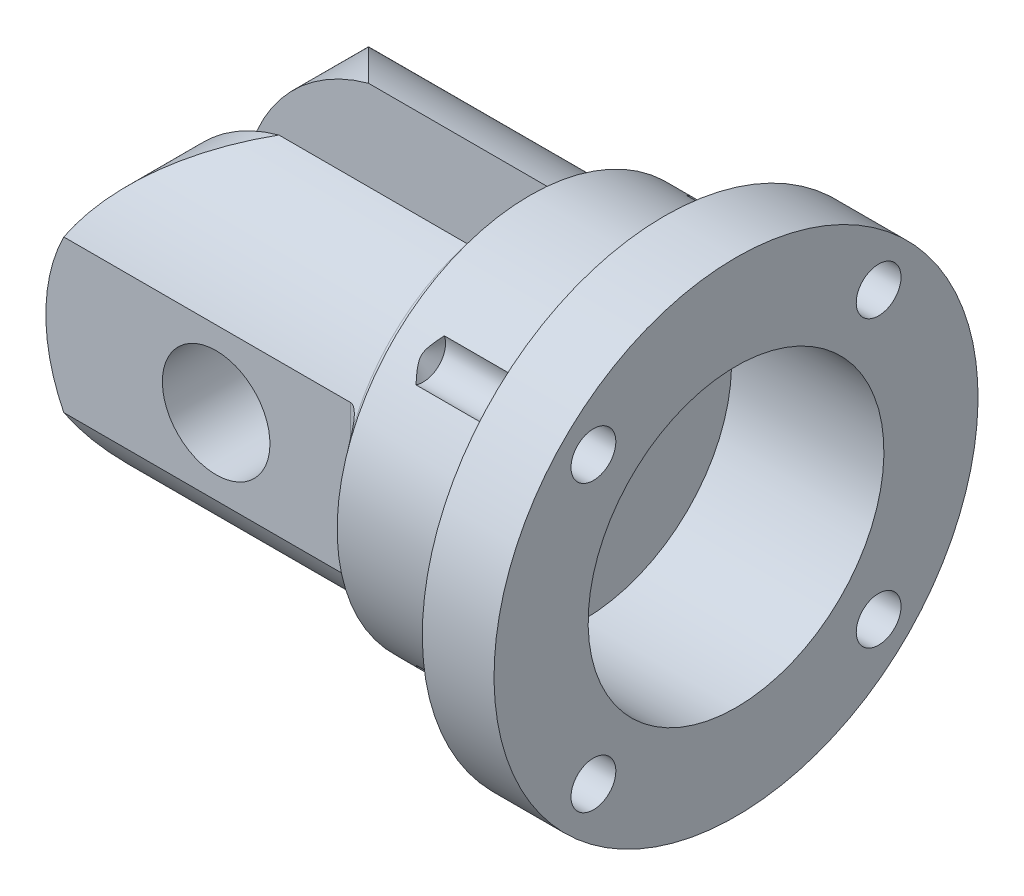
ISO-10303-21;
HEADER;
FILE_DESCRIPTION(('STEP AP214'),'2;1');
FILE_NAME('part.step','',(''),(''),'','','');
FILE_SCHEMA(('AUTOMOTIVE_DESIGN { 1 0 10303 214 1 1 1 1 }'));
ENDSEC;
DATA;
#1=APPLICATION_CONTEXT('core data for automotive mechanical design processes');
#2=APPLICATION_PROTOCOL_DEFINITION('international standard','automotive_design',2000,#1);
#3=PRODUCT_CONTEXT('',#1,'mechanical');
#4=PRODUCT('Part','Part','',(#3));
#5=PRODUCT_RELATED_PRODUCT_CATEGORY('part','',(#4));
#6=PRODUCT_DEFINITION_FORMATION('','',#4);
#7=PRODUCT_DEFINITION_CONTEXT('part definition',#1,'design');
#8=PRODUCT_DEFINITION('design','',#6,#7);
#9=PRODUCT_DEFINITION_SHAPE('','',#8);
#10=(LENGTH_UNIT() NAMED_UNIT(*) SI_UNIT(.MILLI.,.METRE.));
#11=(NAMED_UNIT(*) PLANE_ANGLE_UNIT() SI_UNIT($,.RADIAN.));
#12=(NAMED_UNIT(*) SI_UNIT($,.STERADIAN.) SOLID_ANGLE_UNIT());
#13=UNCERTAINTY_MEASURE_WITH_UNIT(LENGTH_MEASURE(1.E-05),#10,'distance_accuracy_value','');
#14=(GEOMETRIC_REPRESENTATION_CONTEXT(3) GLOBAL_UNCERTAINTY_ASSIGNED_CONTEXT((#13)) GLOBAL_UNIT_ASSIGNED_CONTEXT((#10,
#11,#12)) REPRESENTATION_CONTEXT('',''));
#15=CARTESIAN_POINT('',(0.,0.,0.));
#16=DIRECTION('',(0.,0.,1.));
#17=DIRECTION('',(1.,0.,0.));
#18=AXIS2_PLACEMENT_3D('',#15,#16,#17);
#19=CARTESIAN_POINT('',(3.89664127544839,7.91010216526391,18.));
#20=DIRECTION('',(0.,-1.,0.));
#21=DIRECTION('',(1.,0.,0.));
#22=AXIS2_PLACEMENT_3D('',#19,#20,#21);
#23=CYLINDRICAL_SURFACE('',#22,1.);
#24=CARTESIAN_POINT('',(3.89664127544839,7.80827878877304,17.));
#25=CARTESIAN_POINT('',(3.92396058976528,7.80834012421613,16.999967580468));
#26=CARTESIAN_POINT('',(3.95119120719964,7.8060391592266,17.0011179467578));
#27=CARTESIAN_POINT('',(4.00451402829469,7.79727688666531,17.0054881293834));
#28=CARTESIAN_POINT('',(4.03061532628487,7.79086059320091,17.0086855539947));
#29=CARTESIAN_POINT('',(4.08714178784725,7.77252730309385,17.0178013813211));
#30=CARTESIAN_POINT('',(4.11718845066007,7.75968715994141,17.0241751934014));
#31=CARTESIAN_POINT('',(4.17464629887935,7.72978797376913,17.0389598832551));
#32=CARTESIAN_POINT('',(4.20204525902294,7.71271054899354,17.0473796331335));
#33=CARTESIAN_POINT('',(4.26867306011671,7.66503007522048,17.0707798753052));
#34=CARTESIAN_POINT('',(4.30593202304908,7.63220883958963,17.0867936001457));
#35=CARTESIAN_POINT('',(4.37462258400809,7.56192990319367,17.1207922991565));
#36=CARTESIAN_POINT('',(4.40604340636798,7.52446383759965,17.1387808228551));
#37=CARTESIAN_POINT('',(4.46295615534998,7.44802079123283,17.1751483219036));
#38=CARTESIAN_POINT('',(4.48862903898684,7.40915660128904,17.1934859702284));
#39=CARTESIAN_POINT('',(4.53629112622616,7.32946932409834,17.230738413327));
#40=CARTESIAN_POINT('',(4.55827675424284,7.28864438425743,17.2496537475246));
#41=CARTESIAN_POINT('',(4.59927653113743,7.20530827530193,17.2878944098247));
#42=CARTESIAN_POINT('',(4.61826840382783,7.16278716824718,17.3072216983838));
#43=CARTESIAN_POINT('',(4.65354865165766,7.07671318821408,17.3459539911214));
#44=CARTESIAN_POINT('',(4.6698383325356,7.03316082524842,17.365358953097));
#45=CARTESIAN_POINT('',(4.70701410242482,6.92514965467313,17.4129887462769));
#46=CARTESIAN_POINT('',(4.72659806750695,6.86023356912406,17.4411910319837));
#47=CARTESIAN_POINT('',(4.76170763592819,6.72915372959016,17.4972551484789));
#48=CARTESIAN_POINT('',(4.77723128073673,6.66298938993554,17.5251168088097));
#49=CARTESIAN_POINT('',(4.8048812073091,6.52955797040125,17.5804071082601));
#50=CARTESIAN_POINT('',(4.81699785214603,6.46228832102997,17.6078343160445));
#51=CARTESIAN_POINT('',(4.83826343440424,6.32703112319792,17.6620730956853));
#52=CARTESIAN_POINT('',(4.84741182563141,6.25904344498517,17.6888845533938));
#53=CARTESIAN_POINT('',(4.87020830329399,6.06106882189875,17.7656332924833));
#54=CARTESIAN_POINT('',(4.88049879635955,5.93033803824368,17.8146725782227));
#55=CARTESIAN_POINT('',(4.8904021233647,5.73371226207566,17.8859599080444));
#56=CARTESIAN_POINT('',(4.89278236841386,5.66830918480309,17.909267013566));
#57=CARTESIAN_POINT('',(4.89590050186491,5.53723268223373,17.9551691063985));
#58=CARTESIAN_POINT('',(4.89663880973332,5.47155933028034,17.9777642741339));
#59=CARTESIAN_POINT('',(4.89664127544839,5.40575994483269,18.));
#60=B_SPLINE_CURVE_WITH_KNOTS('',3,(#24,#25,#26,#27,#28,#29,#30,#31,#32,#33,#34,#35,#36,#37,#38,
#39,#40,#41,#42,#43,#44,#45,#46,#47,#48,#49,#50,#51,#52,#53,#54,#55,#56,#57,#58,#59),
.UNSPECIFIED.,.F.,.F.,(4,2,2,2,2,2,2,2,2,2,2,2,2,2,2,2,2,4),(0.,0.081693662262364,
0.162508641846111,0.261829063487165,0.361588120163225,0.517224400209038,0.673145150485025,
0.823095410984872,0.973190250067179,1.12435397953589,1.27544445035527,1.49559205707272,
1.71584565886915,1.93671613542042,2.15762723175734,2.57730518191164,2.78570744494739,
2.99405646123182),.UNSPECIFIED.);
#61=CARTESIAN_POINT('',(3.89664127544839,7.80827878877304,17.));
#62=VERTEX_POINT('',#61);
#63=CARTESIAN_POINT('',(4.89664127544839,5.40575994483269,18.));
#64=VERTEX_POINT('',#63);
#65=EDGE_CURVE('E198',#62,#64,#60,.T.);
#66=ORIENTED_EDGE('',*,*,#65,.F.);
#67=DIRECTION('',(0.,1.,0.));
#68=VECTOR('',#67,1.);
#69=CARTESIAN_POINT('',(3.89664127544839,12.8122112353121,17.));
#70=LINE('',#69,#68);
#71=CARTESIAN_POINT('',(3.89664127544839,-9.16228395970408,17.));
#72=VERTEX_POINT('',#71);
#73=EDGE_CURVE('E190',#62,#72,#70,.F.);
#74=ORIENTED_EDGE('',*,*,#73,.T.);
#75=CARTESIAN_POINT('',(4.89664127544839,-6.75976511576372,18.));
#76=CARTESIAN_POINT('',(4.89663883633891,-6.82110537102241,17.9792713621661));
#77=CARTESIAN_POINT('',(4.8959970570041,-6.88233936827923,17.9582289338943));
#78=CARTESIAN_POINT('',(4.89329702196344,-7.00457262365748,17.9155253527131));
#79=CARTESIAN_POINT('',(4.89123849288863,-7.06557183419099,17.8938640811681));
#80=CARTESIAN_POINT('',(4.88270809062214,-7.24864741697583,17.8277974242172));
#81=CARTESIAN_POINT('',(4.87387911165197,-7.37029817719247,17.782479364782));
#82=CARTESIAN_POINT('',(4.848538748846,-7.61139545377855,17.6898493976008));
#83=CARTESIAN_POINT('',(4.83206527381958,-7.73084985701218,17.6425483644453));
#84=CARTESIAN_POINT('',(4.79999972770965,-7.90805793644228,17.5703132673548));
#85=CARTESIAN_POINT('',(4.78809752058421,-7.96675316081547,17.5460404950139));
#86=CARTESIAN_POINT('',(4.76146135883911,-8.08334436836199,17.4971452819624));
#87=CARTESIAN_POINT('',(4.74672799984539,-8.14124051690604,17.4725229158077));
#88=CARTESIAN_POINT('',(4.71241817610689,-8.26140175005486,17.4207222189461));
#89=CARTESIAN_POINT('',(4.69251648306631,-8.3235654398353,17.3935213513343));
#90=CARTESIAN_POINT('',(4.64781732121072,-8.44652007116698,17.3389485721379));
#91=CARTESIAN_POINT('',(4.62299409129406,-8.50730182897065,17.3115765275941));
#92=CARTESIAN_POINT('',(4.57678591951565,-8.60611106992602,17.2664736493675));
#93=CARTESIAN_POINT('',(4.55708722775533,-8.64486836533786,17.2486194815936));
#94=CARTESIAN_POINT('',(4.51458736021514,-8.72090127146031,17.2132928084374));
#95=CARTESIAN_POINT('',(4.49178352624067,-8.75817557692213,17.1958206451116));
#96=CARTESIAN_POINT('',(4.44269889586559,-8.83033590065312,17.1617229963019));
#97=CARTESIAN_POINT('',(4.41644517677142,-8.86523759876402,17.1450921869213));
#98=CARTESIAN_POINT('',(4.35968171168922,-8.93196308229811,17.113064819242));
#99=CARTESIAN_POINT('',(4.32918202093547,-8.96379384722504,17.0976654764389));
#100=CARTESIAN_POINT('',(4.27288868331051,-9.0141872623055,17.0731336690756));
#101=CARTESIAN_POINT('',(4.2483543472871,-9.03389668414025,17.0634911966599));
#102=CARTESIAN_POINT('',(4.19655234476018,-9.07024847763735,17.045639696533));
#103=CARTESIAN_POINT('',(4.16928271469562,-9.08688862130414,17.0374317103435));
#104=CARTESIAN_POINT('',(4.1116541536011,-9.11620266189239,17.0229308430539));
#105=CARTESIAN_POINT('',(4.08125721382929,-9.12881757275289,17.0166664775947));
#106=CARTESIAN_POINT('',(4.01830729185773,-9.1484035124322,17.0069247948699));
#107=CARTESIAN_POINT('',(3.98576376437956,-9.15539770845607,17.0034360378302));
#108=CARTESIAN_POINT('',(3.94350315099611,-9.16017167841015,17.0010541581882));
#109=CARTESIAN_POINT('',(3.9341538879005,-9.16096241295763,17.0006595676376));
#110=CARTESIAN_POINT('',(3.91541851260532,-9.16201807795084,17.0001327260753));
#111=CARTESIAN_POINT('',(3.90603240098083,-9.16228301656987,17.0000004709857));
#112=CARTESIAN_POINT('',(3.8966412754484,-9.16228395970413,17.));
#113=B_SPLINE_CURVE_WITH_KNOTS('',3,(#75,#76,#77,#78,#79,#80,#81,#82,#83,#84,#85,#86,#87,#88,
#89,#90,#91,#92,#93,#94,#95,#96,#97,#98,#99,#100,#101,#102,#103,#104,#105,#106,#107,#108,#109,
#110,#111,#112),.UNSPECIFIED.,.F.,.F.,(4,2,2,2,2,2,2,2,2,2,2,2,2,2,2,2,2,2,4),(0.,
0.194237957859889,0.388513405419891,0.778657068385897,1.16688636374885,1.36069756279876,
1.55446803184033,1.76646791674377,1.97960826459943,2.12050805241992,2.26152922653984,
2.40150318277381,2.54115112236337,2.63967279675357,2.73826570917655,2.83824330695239,
2.93780667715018,2.96596594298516,2.99412477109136),.UNSPECIFIED.);
#114=CARTESIAN_POINT('',(4.89664127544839,-6.75976511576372,18.));
#115=VERTEX_POINT('',#114);
#116=EDGE_CURVE('E996',#115,#72,#113,.T.);
#117=ORIENTED_EDGE('',*,*,#116,.F.);
#118=DIRECTION('',(0.,1.,0.));
#119=VECTOR('',#118,1.);
#120=CARTESIAN_POINT('',(4.89664127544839,-2.78654609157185,18.));
#121=LINE('',#120,#119);
#122=EDGE_CURVE('E1003',#115,#64,#121,.T.);
#123=ORIENTED_EDGE('',*,*,#122,.T.);
#124=EDGE_LOOP('',(#66,#74,#117,#123));
#125=FACE_BOUND('',#124,.T.);
#126=ADVANCED_FACE('F17',(#125),#23,.F.);
#127=CARTESIAN_POINT('',(-30.1033587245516,12.8122112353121,17.));
#128=DIRECTION('',(0.,0.,-1.));
#129=DIRECTION('',(0.,1.,0.));
#130=AXIS2_PLACEMENT_3D('',#127,#128,#129);
#131=PLANE('',#130);
#132=DIRECTION('',(1.,0.,0.));
#133=VECTOR('',#132,1.);
#134=CARTESIAN_POINT('',(-11.6033587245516,-9.16228395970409,17.));
#135=LINE('',#134,#133);
#136=CARTESIAN_POINT('',(-28.1033587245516,-9.16228395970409,17.));
#137=VERTEX_POINT('',#136);
#138=EDGE_CURVE('E1002',#72,#137,#135,.F.);
#139=ORIENTED_EDGE('',*,*,#138,.F.);
#140=ORIENTED_EDGE('',*,*,#73,.F.);
#141=DIRECTION('',(1.,0.,0.));
#142=VECTOR('',#141,1.);
#143=CARTESIAN_POINT('',(-11.6033587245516,7.80827878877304,17.));
#144=LINE('',#143,#142);
#145=CARTESIAN_POINT('',(-28.1033587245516,7.80827878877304,17.));
#146=VERTEX_POINT('',#145);
#147=EDGE_CURVE('E192',#146,#62,#144,.T.);
#148=ORIENTED_EDGE('',*,*,#147,.F.);
#149=CARTESIAN_POINT('',(-11.1033587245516,-0.677002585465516,17.));
#150=DIRECTION('',(0.,0.,1.));
#151=DIRECTION('',(0.,-1.,0.));
#152=AXIS2_PLACEMENT_3D('',#149,#150,#151);
#153=CIRCLE('',#152,19.);
#154=EDGE_CURVE('E21',#146,#137,#153,.T.);
#155=ORIENTED_EDGE('',*,*,#154,.T.);
#156=EDGE_LOOP('',(#139,#140,#148,#155));
#157=FACE_BOUND('',#156,.T.);
#158=CARTESIAN_POINT('',(-11.1033587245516,-0.677002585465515,17.));
#159=DIRECTION('',(0.,0.,-1.));
#160=DIRECTION('',(0.,1.,0.));
#161=AXIS2_PLACEMENT_3D('',#158,#159,#160);
#162=CIRCLE('',#161,6.);
#163=CARTESIAN_POINT('',(-11.1033587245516,5.32299741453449,17.));
#164=VERTEX_POINT('',#163);
#165=EDGE_CURVE('E189',#164,#164,#162,.T.);
#166=ORIENTED_EDGE('',*,*,#165,.T.);
#167=EDGE_LOOP('',(#166));
#168=FACE_BOUND('',#167,.T.);
#169=ADVANCED_FACE('F193',(#157,#168),#131,.F.);
#170=CARTESIAN_POINT('',(-11.1033587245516,-0.677002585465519,4.99999999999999));
#171=DIRECTION('',(0.,0.,1.));
#172=DIRECTION('',(0.,-1.,0.));
#173=AXIS2_PLACEMENT_3D('',#170,#171,#172);
#174=CYLINDRICAL_SURFACE('',#173,19.);
#175=CARTESIAN_POINT('',(-11.1033587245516,-0.677002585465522,0.));
#176=DIRECTION('',(0.707106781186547,0.,0.707106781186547));
#177=DIRECTION('',(-0.707106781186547,0.,0.707106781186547));
#178=AXIS2_PLACEMENT_3D('',#175,#176,#177);
#179=ELLIPSE('',#178,26.8700576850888,19.);
#180=CARTESIAN_POINT('',(-16.1033587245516,-19.0073053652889,4.99999999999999));
#181=VERTEX_POINT('',#180);
#182=EDGE_CURVE('E185',#137,#181,#179,.T.);
#183=ORIENTED_EDGE('',*,*,#182,.F.);
#184=ORIENTED_EDGE('',*,*,#154,.F.);
#185=CARTESIAN_POINT('',(-11.1033587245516,-0.677002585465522,0.));
#186=DIRECTION('',(0.707106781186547,0.,0.707106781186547));
#187=DIRECTION('',(-0.707106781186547,0.,0.707106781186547));
#188=AXIS2_PLACEMENT_3D('',#185,#186,#187);
#189=ELLIPSE('',#188,26.8700576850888,19.);
#190=CARTESIAN_POINT('',(-16.1033587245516,17.6533001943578,4.99999999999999));
#191=VERTEX_POINT('',#190);
#192=EDGE_CURVE('E182',#191,#146,#189,.T.);
#193=ORIENTED_EDGE('',*,*,#192,.F.);
#194=CARTESIAN_POINT('',(-11.1033587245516,-0.677002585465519,4.99999999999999));
#195=DIRECTION('',(0.,0.,1.));
#196=DIRECTION('',(0.,-1.,0.));
#197=AXIS2_PLACEMENT_3D('',#194,#195,#196);
#198=CIRCLE('',#197,19.);
#199=EDGE_CURVE('E1032',#191,#181,#198,.T.);
#200=ORIENTED_EDGE('',*,*,#199,.T.);
#201=EDGE_LOOP('',(#183,#184,#193,#200));
#202=FACE_BOUND('',#201,.T.);
#203=ADVANCED_FACE('F180',(#202),#174,.T.);
#204=CARTESIAN_POINT('',(-11.1033587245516,-0.677002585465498,80.1184843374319));
#205=DIRECTION('',(0.,0.,-1.));
#206=DIRECTION('',(0.,1.,0.));
#207=AXIS2_PLACEMENT_3D('',#204,#205,#206);
#208=CYLINDRICAL_SURFACE('',#207,6.);
#209=ORIENTED_EDGE('',*,*,#165,.F.);
#210=EDGE_LOOP('',(#209));
#211=FACE_BOUND('',#210,.T.);
#212=CARTESIAN_POINT('',(-11.1033587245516,-0.677002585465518,4.99999999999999));
#213=DIRECTION('',(0.,0.,-1.));
#214=DIRECTION('',(0.,1.,0.));
#215=AXIS2_PLACEMENT_3D('',#212,#213,#214);
#216=CIRCLE('',#215,6.);
#217=CARTESIAN_POINT('',(-11.1033587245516,5.32299741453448,4.99999999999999));
#218=VERTEX_POINT('',#217);
#219=EDGE_CURVE('E1029',#218,#218,#216,.T.);
#220=ORIENTED_EDGE('',*,*,#219,.T.);
#221=EDGE_LOOP('',(#220));
#222=FACE_BOUND('',#221,.T.);
#223=ADVANCED_FACE('F967',(#211,#222),#208,.F.);
#224=CARTESIAN_POINT('',(3.89664127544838,-9.26410733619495,-18.));
#225=DIRECTION('',(0.,1.,0.));
#226=DIRECTION('',(-1.,0.,0.));
#227=AXIS2_PLACEMENT_3D('',#224,#225,#226);
#228=CYLINDRICAL_SURFACE('',#227,1.);
#229=CARTESIAN_POINT('',(3.89664127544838,-9.16228395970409,-17.));
#230=CARTESIAN_POINT('',(3.92396058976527,-9.16234529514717,-16.999967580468));
#231=CARTESIAN_POINT('',(3.95119120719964,-9.16004433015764,-17.0011179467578));
#232=CARTESIAN_POINT('',(4.00451402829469,-9.15128205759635,-17.0054881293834));
#233=CARTESIAN_POINT('',(4.03061532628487,-9.14486576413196,-17.0086855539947));
#234=CARTESIAN_POINT('',(4.08714178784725,-9.12653247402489,-17.0178013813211));
#235=CARTESIAN_POINT('',(4.11718845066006,-9.11369233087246,-17.0241751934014));
#236=CARTESIAN_POINT('',(4.17464629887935,-9.08379314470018,-17.0389598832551));
#237=CARTESIAN_POINT('',(4.20204525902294,-9.06671571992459,-17.0473796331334));
#238=CARTESIAN_POINT('',(4.2686730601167,-9.01903524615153,-17.0707798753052));
#239=CARTESIAN_POINT('',(4.30593202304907,-8.98621401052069,-17.0867936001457));
#240=CARTESIAN_POINT('',(4.37462258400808,-8.91593507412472,-17.1207922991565));
#241=CARTESIAN_POINT('',(4.40604340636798,-8.8784690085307,-17.1387808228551));
#242=CARTESIAN_POINT('',(4.46295615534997,-8.80202596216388,-17.1751483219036));
#243=CARTESIAN_POINT('',(4.48862903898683,-8.7631617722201,-17.1934859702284));
#244=CARTESIAN_POINT('',(4.53629112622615,-8.6834744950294,-17.2307384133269));
#245=CARTESIAN_POINT('',(4.55827675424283,-8.64264955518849,-17.2496537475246));
#246=CARTESIAN_POINT('',(4.59927653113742,-8.55931344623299,-17.2878944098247));
#247=CARTESIAN_POINT('',(4.61826840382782,-8.51679233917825,-17.3072216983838));
#248=CARTESIAN_POINT('',(4.65354865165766,-8.43071835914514,-17.3459539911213));
#249=CARTESIAN_POINT('',(4.6698383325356,-8.38716599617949,-17.365358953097));
#250=CARTESIAN_POINT('',(4.70701410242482,-8.2791548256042,-17.4129887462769));
#251=CARTESIAN_POINT('',(4.72659806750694,-8.21423874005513,-17.4411910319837));
#252=CARTESIAN_POINT('',(4.76170763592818,-8.08315890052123,-17.4972551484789));
#253=CARTESIAN_POINT('',(4.77723128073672,-8.01699456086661,-17.5251168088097));
#254=CARTESIAN_POINT('',(4.8048812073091,-7.88356314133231,-17.5804071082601));
#255=CARTESIAN_POINT('',(4.81699785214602,-7.81629349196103,-17.6078343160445));
#256=CARTESIAN_POINT('',(4.83826343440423,-7.68103629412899,-17.6620730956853));
#257=CARTESIAN_POINT('',(4.8474118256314,-7.61304861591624,-17.6888845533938));
#258=CARTESIAN_POINT('',(4.87020830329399,-7.41507399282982,-17.7656332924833));
#259=CARTESIAN_POINT('',(4.88049879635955,-7.28434320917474,-17.8146725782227));
#260=CARTESIAN_POINT('',(4.89040212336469,-7.08771743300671,-17.8859599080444));
#261=CARTESIAN_POINT('',(4.89278236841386,-7.02231435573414,-17.909267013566));
#262=CARTESIAN_POINT('',(4.8959005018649,-6.89123785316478,-17.9551691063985));
#263=CARTESIAN_POINT('',(4.89663880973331,-6.82556450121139,-17.9777642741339));
#264=CARTESIAN_POINT('',(4.89664127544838,-6.75976511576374,-18.));
#265=B_SPLINE_CURVE_WITH_KNOTS('',3,(#229,#230,#231,#232,#233,#234,#235,#236,#237,#238,#239,
#240,#241,#242,#243,#244,#245,#246,#247,#248,#249,#250,#251,#252,#253,#254,#255,#256,#257,#258,
#259,#260,#261,#262,#263,#264),.UNSPECIFIED.,.F.,.F.,(4,2,2,2,2,2,2,2,2,2,2,2,2,2,2,2,2,4),(0.,
0.0816936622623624,0.162508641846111,0.261829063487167,0.361588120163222,0.517224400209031,
0.673145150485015,0.82309541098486,0.973190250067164,1.12435397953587,1.27544445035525,
1.4955920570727,1.71584565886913,1.9367161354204,2.15762723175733,2.57730518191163,
2.78570744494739,2.99405646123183),.UNSPECIFIED.);
#266=CARTESIAN_POINT('',(3.89664127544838,-9.16228395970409,-17.));
#267=VERTEX_POINT('',#266);
#268=CARTESIAN_POINT('',(4.89664127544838,-6.75976511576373,-18.));
#269=VERTEX_POINT('',#268);
#270=EDGE_CURVE('E1016',#267,#269,#265,.T.);
#271=ORIENTED_EDGE('',*,*,#270,.F.);
#272=DIRECTION('',(0.,-1.,0.));
#273=VECTOR('',#272,1.);
#274=CARTESIAN_POINT('',(3.89664127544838,-19.0310350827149,-17.));
#275=LINE('',#274,#273);
#276=CARTESIAN_POINT('',(3.89664127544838,7.80827878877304,-17.));
#277=VERTEX_POINT('',#276);
#278=EDGE_CURVE('E217',#267,#277,#275,.F.);
#279=ORIENTED_EDGE('',*,*,#278,.T.);
#280=CARTESIAN_POINT('',(4.89664127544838,5.40575994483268,-18.));
#281=CARTESIAN_POINT('',(4.8966388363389,5.46710020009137,-17.9792713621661));
#282=CARTESIAN_POINT('',(4.89599705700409,5.5283341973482,-17.9582289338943));
#283=CARTESIAN_POINT('',(4.89329702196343,5.65056745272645,-17.9155253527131));
#284=CARTESIAN_POINT('',(4.89123849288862,5.71156666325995,-17.8938640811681));
#285=CARTESIAN_POINT('',(4.88270809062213,5.8946422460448,-17.8277974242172));
#286=CARTESIAN_POINT('',(4.87387911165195,6.01629300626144,-17.782479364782));
#287=CARTESIAN_POINT('',(4.84853874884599,6.25739028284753,-17.6898493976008));
#288=CARTESIAN_POINT('',(4.83206527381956,6.37684468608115,-17.6425483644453));
#289=CARTESIAN_POINT('',(4.79999972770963,6.55405276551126,-17.5703132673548));
#290=CARTESIAN_POINT('',(4.7880975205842,6.61274798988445,-17.5460404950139));
#291=CARTESIAN_POINT('',(4.7614613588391,6.72933919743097,-17.4971452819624));
#292=CARTESIAN_POINT('',(4.74672799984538,6.78723534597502,-17.4725229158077));
#293=CARTESIAN_POINT('',(4.71241817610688,6.90739657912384,-17.4207222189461));
#294=CARTESIAN_POINT('',(4.6925164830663,6.96956026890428,-17.3935213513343));
#295=CARTESIAN_POINT('',(4.6478173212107,7.09251490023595,-17.3389485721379));
#296=CARTESIAN_POINT('',(4.62299409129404,7.15329665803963,-17.3115765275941));
#297=CARTESIAN_POINT('',(4.57678591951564,7.25210589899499,-17.2664736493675));
#298=CARTESIAN_POINT('',(4.55708722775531,7.29086319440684,-17.2486194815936));
#299=CARTESIAN_POINT('',(4.51458736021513,7.36689610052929,-17.2132928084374));
#300=CARTESIAN_POINT('',(4.49178352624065,7.40417040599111,-17.1958206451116));
#301=CARTESIAN_POINT('',(4.44269889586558,7.4763307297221,-17.1617229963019));
#302=CARTESIAN_POINT('',(4.41644517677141,7.51123242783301,-17.1450921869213));
#303=CARTESIAN_POINT('',(4.3596817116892,7.57795791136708,-17.113064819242));
#304=CARTESIAN_POINT('',(4.32918202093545,7.60978867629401,-17.0976654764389));
#305=CARTESIAN_POINT('',(4.27288868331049,7.66018209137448,-17.0731336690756));
#306=CARTESIAN_POINT('',(4.24835434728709,7.67989151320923,-17.0634911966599));
#307=CARTESIAN_POINT('',(4.19655234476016,7.71624330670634,-17.045639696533));
#308=CARTESIAN_POINT('',(4.1692827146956,7.73288345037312,-17.0374317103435));
#309=CARTESIAN_POINT('',(4.11165415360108,7.76219749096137,-17.0229308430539));
#310=CARTESIAN_POINT('',(4.08125721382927,7.77481240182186,-17.0166664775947));
#311=CARTESIAN_POINT('',(4.01830729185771,7.79439834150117,-17.0069247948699));
#312=CARTESIAN_POINT('',(3.98576376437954,7.80139253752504,-17.0034360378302));
#313=CARTESIAN_POINT('',(3.9435031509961,7.80616650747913,-17.0010541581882));
#314=CARTESIAN_POINT('',(3.93415388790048,7.80695724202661,-17.0006595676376));
#315=CARTESIAN_POINT('',(3.91541851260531,7.80801290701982,-17.0001327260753));
#316=CARTESIAN_POINT('',(3.90603240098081,7.80827784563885,-17.0000004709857));
#317=CARTESIAN_POINT('',(3.89664127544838,7.8082787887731,-17.));
#318=B_SPLINE_CURVE_WITH_KNOTS('',3,(#280,#281,#282,#283,#284,#285,#286,#287,#288,#289,#290,
#291,#292,#293,#294,#295,#296,#297,#298,#299,#300,#301,#302,#303,#304,#305,#306,#307,#308,#309,
#310,#311,#312,#313,#314,#315,#316,#317),.UNSPECIFIED.,.F.,.F.,(4,2,2,2,2,2,2,2,2,2,2,2,2,2,2,2,
2,2,4),(0.,0.19423795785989,0.388513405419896,0.778657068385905,1.16688636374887,
1.36069756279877,1.55446803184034,1.76646791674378,1.97960826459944,2.12050805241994,
2.26152922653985,2.40150318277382,2.54115112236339,2.63967279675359,2.73826570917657,
2.83824330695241,2.9378066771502,2.96596594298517,2.99412477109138),.UNSPECIFIED.);
#319=CARTESIAN_POINT('',(4.89664127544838,5.40575994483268,-18.));
#320=VERTEX_POINT('',#319);
#321=EDGE_CURVE('E1010',#320,#277,#318,.T.);
#322=ORIENTED_EDGE('',*,*,#321,.F.);
#323=DIRECTION('',(0.,1.,0.));
#324=VECTOR('',#323,1.);
#325=CARTESIAN_POINT('',(4.89664127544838,-2.90600154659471,-18.));
#326=LINE('',#325,#324);
#327=EDGE_CURVE('E1022',#320,#269,#326,.F.);
#328=ORIENTED_EDGE('',*,*,#327,.T.);
#329=EDGE_LOOP('',(#271,#279,#322,#328));
#330=FACE_BOUND('',#329,.T.);
#331=ADVANCED_FACE('F959',(#330),#228,.F.);
#332=CARTESIAN_POINT('',(-30.1033587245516,-19.0310350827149,-17.));
#333=DIRECTION('',(0.,0.,1.));
#334=DIRECTION('',(0.,-1.,0.));
#335=AXIS2_PLACEMENT_3D('',#332,#333,#334);
#336=PLANE('',#335);
#337=CARTESIAN_POINT('',(-11.1033587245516,-0.677002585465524,-17.));
#338=DIRECTION('',(0.,0.,-1.));
#339=DIRECTION('',(0.,1.,0.));
#340=AXIS2_PLACEMENT_3D('',#337,#338,#339);
#341=CIRCLE('',#340,6.);
#342=CARTESIAN_POINT('',(-11.1033587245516,5.32299741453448,-17.));
#343=VERTEX_POINT('',#342);
#344=EDGE_CURVE('E206',#343,#343,#341,.F.);
#345=ORIENTED_EDGE('',*,*,#344,.T.);
#346=EDGE_LOOP('',(#345));
#347=FACE_BOUND('',#346,.T.);
#348=DIRECTION('',(1.,0.,0.));
#349=VECTOR('',#348,1.);
#350=CARTESIAN_POINT('',(-11.6033587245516,7.80827878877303,-17.));
#351=LINE('',#350,#349);
#352=CARTESIAN_POINT('',(-28.1033587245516,7.80827878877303,-17.));
#353=VERTEX_POINT('',#352);
#354=EDGE_CURVE('E1040',#277,#353,#351,.F.);
#355=ORIENTED_EDGE('',*,*,#354,.F.);
#356=ORIENTED_EDGE('',*,*,#278,.F.);
#357=DIRECTION('',(1.,0.,0.));
#358=VECTOR('',#357,1.);
#359=CARTESIAN_POINT('',(-11.6033587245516,-9.1622839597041,-17.));
#360=LINE('',#359,#358);
#361=CARTESIAN_POINT('',(-28.1033587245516,-9.1622839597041,-17.));
#362=VERTEX_POINT('',#361);
#363=EDGE_CURVE('E1023',#362,#267,#360,.T.);
#364=ORIENTED_EDGE('',*,*,#363,.F.);
#365=CARTESIAN_POINT('',(-11.1033587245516,-0.677002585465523,-17.));
#366=DIRECTION('',(0.,0.,1.));
#367=DIRECTION('',(0.,-1.,0.));
#368=AXIS2_PLACEMENT_3D('',#365,#366,#367);
#369=CIRCLE('',#368,19.);
#370=EDGE_CURVE('E204',#362,#353,#369,.F.);
#371=ORIENTED_EDGE('',*,*,#370,.T.);
#372=EDGE_LOOP('',(#355,#356,#364,#371));
#373=FACE_BOUND('',#372,.T.);
#374=ADVANCED_FACE('F951',(#347,#373),#336,.F.);
#375=CARTESIAN_POINT('',(-11.1033587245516,-0.677002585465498,80.1184843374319));
#376=DIRECTION('',(0.,0.,-1.));
#377=DIRECTION('',(0.,1.,0.));
#378=AXIS2_PLACEMENT_3D('',#375,#376,#377);
#379=CYLINDRICAL_SURFACE('',#378,6.);
#380=ORIENTED_EDGE('',*,*,#344,.F.);
#381=EDGE_LOOP('',(#380));
#382=FACE_BOUND('',#381,.T.);
#383=CARTESIAN_POINT('',(-11.1033587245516,-0.677002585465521,-5.));
#384=DIRECTION('',(0.,0.,-1.));
#385=DIRECTION('',(0.,1.,0.));
#386=AXIS2_PLACEMENT_3D('',#383,#384,#385);
#387=CIRCLE('',#386,6.);
#388=CARTESIAN_POINT('',(-11.1033587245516,5.32299741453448,-5.00000000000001));
#389=VERTEX_POINT('',#388);
#390=EDGE_CURVE('E1052',#389,#389,#387,.F.);
#391=ORIENTED_EDGE('',*,*,#390,.T.);
#392=EDGE_LOOP('',(#391));
#393=FACE_BOUND('',#392,.T.);
#394=ADVANCED_FACE('F943',(#382,#393),#379,.F.);
#395=CARTESIAN_POINT('',(-11.1033587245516,-0.677002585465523,-17.));
#396=DIRECTION('',(0.,0.,1.));
#397=DIRECTION('',(0.,-1.,0.));
#398=AXIS2_PLACEMENT_3D('',#395,#396,#397);
#399=CYLINDRICAL_SURFACE('',#398,19.);
#400=CARTESIAN_POINT('',(-11.1033587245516,-0.677002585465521,0.));
#401=DIRECTION('',(-0.707106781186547,0.,0.707106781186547));
#402=DIRECTION('',(0.707106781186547,0.,0.707106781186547));
#403=AXIS2_PLACEMENT_3D('',#400,#401,#402);
#404=ELLIPSE('',#403,26.8700576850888,19.);
#405=CARTESIAN_POINT('',(-16.1033587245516,17.6533001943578,-4.99999999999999));
#406=VERTEX_POINT('',#405);
#407=EDGE_CURVE('E1042',#353,#406,#404,.F.);
#408=ORIENTED_EDGE('',*,*,#407,.F.);
#409=ORIENTED_EDGE('',*,*,#370,.F.);
#410=CARTESIAN_POINT('',(-11.1033587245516,-0.677002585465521,0.));
#411=DIRECTION('',(-0.707106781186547,0.,0.707106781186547));
#412=DIRECTION('',(0.707106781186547,0.,0.707106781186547));
#413=AXIS2_PLACEMENT_3D('',#410,#411,#412);
#414=ELLIPSE('',#413,26.8700576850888,19.);
#415=CARTESIAN_POINT('',(-16.1033587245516,-19.0073053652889,-4.99999999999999));
#416=VERTEX_POINT('',#415);
#417=EDGE_CURVE('E1024',#416,#362,#414,.F.);
#418=ORIENTED_EDGE('',*,*,#417,.F.);
#419=CARTESIAN_POINT('',(-11.1033587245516,-0.677002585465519,-4.99999999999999));
#420=DIRECTION('',(0.,0.,1.));
#421=DIRECTION('',(0.,-1.,0.));
#422=AXIS2_PLACEMENT_3D('',#419,#420,#421);
#423=CIRCLE('',#422,19.);
#424=EDGE_CURVE('E1044',#416,#406,#423,.F.);
#425=ORIENTED_EDGE('',*,*,#424,.T.);
#426=EDGE_LOOP('',(#408,#409,#418,#425));
#427=FACE_BOUND('',#426,.T.);
#428=ADVANCED_FACE('F937',(#427),#399,.T.);
#429=CARTESIAN_POINT('',(-11.6033587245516,-0.677002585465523,0.));
#430=DIRECTION('',(1.,0.,0.));
#431=DIRECTION('',(0.,1.,0.));
#432=AXIS2_PLACEMENT_3D('',#429,#430,#431);
#433=CYLINDRICAL_SURFACE('',#432,19.);
#434=ORIENTED_EDGE('',*,*,#65,.T.);
#435=CARTESIAN_POINT('',(4.89664127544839,-0.677002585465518,0.));
#436=DIRECTION('',(1.,0.,0.));
#437=DIRECTION('',(0.,0.,-1.));
#438=AXIS2_PLACEMENT_3D('',#435,#436,#437);
#439=CIRCLE('',#438,19.);
#440=CARTESIAN_POINT('',(4.89664127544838,17.6533001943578,5.));
#441=VERTEX_POINT('',#440);
#442=EDGE_CURVE('E485',#441,#64,#439,.T.);
#443=ORIENTED_EDGE('',*,*,#442,.F.);
#444=DIRECTION('',(1.,0.,0.));
#445=VECTOR('',#444,1.);
#446=CARTESIAN_POINT('',(-30.1033587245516,17.6533001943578,5.));
#447=LINE('',#446,#445);
#448=EDGE_CURVE('E202',#441,#191,#447,.F.);
#449=ORIENTED_EDGE('',*,*,#448,.T.);
#450=ORIENTED_EDGE('',*,*,#192,.T.);
#451=ORIENTED_EDGE('',*,*,#147,.T.);
#452=EDGE_LOOP('',(#434,#443,#449,#450,#451));
#453=FACE_BOUND('',#452,.T.);
#454=ADVANCED_FACE('F200',(#453),#433,.T.);
#455=CARTESIAN_POINT('',(4.89664127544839,-2.78654609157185,22.3688746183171));
#456=DIRECTION('',(1.,0.,0.));
#457=DIRECTION('',(0.,0.,-1.));
#458=AXIS2_PLACEMENT_3D('',#455,#456,#457);
#459=PLANE('',#458);
#460=CARTESIAN_POINT('',(4.89664127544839,-0.677002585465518,0.));
#461=DIRECTION('',(1.,0.,0.));
#462=DIRECTION('',(0.,1.,0.));
#463=AXIS2_PLACEMENT_3D('',#460,#461,#462);
#464=CIRCLE('',#463,19.);
#465=EDGE_CURVE('E558',#64,#115,#464,.T.);
#466=ORIENTED_EDGE('',*,*,#465,.F.);
#467=ORIENTED_EDGE('',*,*,#122,.F.);
#468=EDGE_LOOP('',(#466,#467));
#469=FACE_BOUND('',#468,.T.);
#470=ADVANCED_FACE('F923',(#469),#459,.F.);
#471=CARTESIAN_POINT('',(-11.6033587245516,-0.677002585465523,0.));
#472=DIRECTION('',(1.,0.,0.));
#473=DIRECTION('',(0.,1.,0.));
#474=AXIS2_PLACEMENT_3D('',#471,#472,#473);
#475=CYLINDRICAL_SURFACE('',#474,19.);
#476=ORIENTED_EDGE('',*,*,#138,.T.);
#477=ORIENTED_EDGE('',*,*,#182,.T.);
#478=DIRECTION('',(1.,0.,0.));
#479=VECTOR('',#478,1.);
#480=CARTESIAN_POINT('',(-30.1033587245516,-19.0073053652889,5.));
#481=LINE('',#480,#479);
#482=CARTESIAN_POINT('',(4.8966412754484,-19.0073053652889,5.));
#483=VERTEX_POINT('',#482);
#484=EDGE_CURVE('E1031',#181,#483,#481,.T.);
#485=ORIENTED_EDGE('',*,*,#484,.T.);
#486=CARTESIAN_POINT('',(4.89664127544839,-0.677002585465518,0.));
#487=DIRECTION('',(1.,0.,0.));
#488=DIRECTION('',(0.,0.,-1.));
#489=AXIS2_PLACEMENT_3D('',#486,#487,#488);
#490=CIRCLE('',#489,19.);
#491=EDGE_CURVE('E554',#115,#483,#490,.T.);
#492=ORIENTED_EDGE('',*,*,#491,.F.);
#493=ORIENTED_EDGE('',*,*,#116,.T.);
#494=EDGE_LOOP('',(#476,#477,#485,#492,#493));
#495=FACE_BOUND('',#494,.T.);
#496=ADVANCED_FACE('F916',(#495),#475,.T.);
#497=CARTESIAN_POINT('',(-30.1033587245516,-27.3771089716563,5.));
#498=DIRECTION('',(0.,0.,1.));
#499=DIRECTION('',(0.,-1.,0.));
#500=AXIS2_PLACEMENT_3D('',#497,#498,#499);
#501=PLANE('',#500);
#502=ORIENTED_EDGE('',*,*,#219,.F.);
#503=EDGE_LOOP('',(#502));
#504=FACE_BOUND('',#503,.T.);
#505=CARTESIAN_POINT('',(4.8966412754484,-19.0073053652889,5.));
#506=CARTESIAN_POINT('',(4.95207456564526,-19.0072976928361,5.));
#507=CARTESIAN_POINT('',(5.00750635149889,-19.0096939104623,5.));
#508=CARTESIAN_POINT('',(5.11793738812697,-19.0192366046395,5.));
#509=CARTESIAN_POINT('',(5.17293680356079,-19.026381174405,5.));
#510=CARTESIAN_POINT('',(5.28091374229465,-19.0451536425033,5.));
#511=CARTESIAN_POINT('',(5.33390909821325,-19.0566791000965,4.99999999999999));
#512=CARTESIAN_POINT('',(5.43875855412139,-19.084117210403,5.));
#513=CARTESIAN_POINT('',(5.49061245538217,-19.1000306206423,5.00000000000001));
#514=CARTESIAN_POINT('',(5.60343701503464,-19.1398660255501,5.00000000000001));
#515=CARTESIAN_POINT('',(5.66406488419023,-19.1647648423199,4.99999999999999));
#516=CARTESIAN_POINT('',(5.78257127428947,-19.220475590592,5.));
#517=CARTESIAN_POINT('',(5.84044865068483,-19.2512899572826,5.00000000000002));
#518=CARTESIAN_POINT('',(5.89664127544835,-19.2849005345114,5.0000000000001));
#519=B_SPLINE_CURVE_WITH_KNOTS('',3,(#505,#506,#507,#508,#509,#510,#511,#512,#513,#514,#515,
#516,#517,#518),.UNSPECIFIED.,.F.,.F.,(4,2,2,2,2,2,4),(0.,0.166245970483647,0.332425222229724,
0.494936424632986,0.657475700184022,0.853766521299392,1.05013832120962),.UNSPECIFIED.);
#520=CARTESIAN_POINT('',(5.89664127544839,-19.2849005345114,5.));
#521=VERTEX_POINT('',#520);
#522=EDGE_CURVE('E553',#483,#521,#519,.T.);
#523=ORIENTED_EDGE('',*,*,#522,.F.);
#524=ORIENTED_EDGE('',*,*,#484,.F.);
#525=ORIENTED_EDGE('',*,*,#199,.F.);
#526=ORIENTED_EDGE('',*,*,#448,.F.);
#527=CARTESIAN_POINT('',(5.89664127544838,17.9308953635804,5.));
#528=CARTESIAN_POINT('',(5.84907715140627,17.9024523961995,5.));
#529=CARTESIAN_POINT('',(5.80031453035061,17.8760091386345,5.));
#530=CARTESIAN_POINT('',(5.70072006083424,17.8273088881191,5.));
#531=CARTESIAN_POINT('',(5.64988746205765,17.8050534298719,5.));
#532=CARTESIAN_POINT('',(5.54766629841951,17.7653830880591,5.));
#533=CARTESIAN_POINT('',(5.49631527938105,17.747871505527,5.));
#534=CARTESIAN_POINT('',(5.39235452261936,17.7171984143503,5.));
#535=CARTESIAN_POINT('',(5.33974530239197,17.7040351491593,5.));
#536=CARTESIAN_POINT('',(5.22300248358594,17.6799810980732,5.));
#537=CARTESIAN_POINT('',(5.15866495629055,17.6700686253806,5.));
#538=CARTESIAN_POINT('',(5.02843750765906,17.6566752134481,5.00000000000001));
#539=CARTESIAN_POINT('',(4.96253837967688,17.6532837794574,5.00000000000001));
#540=CARTESIAN_POINT('',(4.89664127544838,17.6533001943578,5.00000000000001));
#541=B_SPLINE_CURVE_WITH_KNOTS('',3,(#527,#528,#529,#530,#531,#532,#533,#534,#535,#536,#537,
#538,#539,#540),.UNSPECIFIED.,.F.,.F.,(4,2,2,2,2,2,4),(0.,0.166214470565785,0.332489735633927,
0.495064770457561,0.657574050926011,0.852526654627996,1.05013651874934),.UNSPECIFIED.);
#542=CARTESIAN_POINT('',(5.89664127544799,17.930895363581,5.00000000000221));
#543=VERTEX_POINT('',#542);
#544=EDGE_CURVE('E610',#543,#441,#541,.T.);
#545=ORIENTED_EDGE('',*,*,#544,.F.);
#546=DIRECTION('',(0.,1.,0.));
#547=VECTOR('',#546,1.);
#548=CARTESIAN_POINT('',(5.89664127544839,-3.90205577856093,5.));
#549=LINE('',#548,#547);
#550=EDGE_CURVE('E525',#521,#543,#549,.T.);
#551=ORIENTED_EDGE('',*,*,#550,.F.);
#552=EDGE_LOOP('',(#523,#524,#525,#526,#545,#551));
#553=FACE_BOUND('',#552,.T.);
#554=ADVANCED_FACE('F574',(#504,#553),#501,.F.);
#555=CARTESIAN_POINT('',(-11.6033587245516,-0.677002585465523,0.));
#556=DIRECTION('',(1.,0.,0.));
#557=DIRECTION('',(0.,1.,0.));
#558=AXIS2_PLACEMENT_3D('',#555,#556,#557);
#559=CYLINDRICAL_SURFACE('',#558,19.);
#560=ORIENTED_EDGE('',*,*,#270,.T.);
#561=CARTESIAN_POINT('',(4.89664127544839,-0.677002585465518,0.));
#562=DIRECTION('',(1.,0.,0.));
#563=DIRECTION('',(0.,0.,-1.));
#564=AXIS2_PLACEMENT_3D('',#561,#562,#563);
#565=CIRCLE('',#564,19.);
#566=CARTESIAN_POINT('',(4.8966412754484,-19.0073053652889,-5.));
#567=VERTEX_POINT('',#566);
#568=EDGE_CURVE('E452',#567,#269,#565,.T.);
#569=ORIENTED_EDGE('',*,*,#568,.F.);
#570=DIRECTION('',(1.,0.,0.));
#571=VECTOR('',#570,1.);
#572=CARTESIAN_POINT('',(-30.1033587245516,-19.0073053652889,-5.));
#573=LINE('',#572,#571);
#574=EDGE_CURVE('E589',#567,#416,#573,.F.);
#575=ORIENTED_EDGE('',*,*,#574,.T.);
#576=ORIENTED_EDGE('',*,*,#417,.T.);
#577=ORIENTED_EDGE('',*,*,#363,.T.);
#578=EDGE_LOOP('',(#560,#569,#575,#576,#577));
#579=FACE_BOUND('',#578,.T.);
#580=ADVANCED_FACE('F902',(#579),#559,.T.);
#581=CARTESIAN_POINT('',(4.89664127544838,-2.90600154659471,-22.8684546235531));
#582=DIRECTION('',(1.,0.,0.));
#583=DIRECTION('',(0.,0.,-1.));
#584=AXIS2_PLACEMENT_3D('',#581,#582,#583);
#585=PLANE('',#584);
#586=CARTESIAN_POINT('',(4.89664127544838,-0.677002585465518,0.));
#587=DIRECTION('',(1.,0.,0.));
#588=DIRECTION('',(0.,1.,0.));
#589=AXIS2_PLACEMENT_3D('',#586,#587,#588);
#590=CIRCLE('',#589,19.);
#591=EDGE_CURVE('E455',#269,#320,#590,.T.);
#592=ORIENTED_EDGE('',*,*,#591,.F.);
#593=ORIENTED_EDGE('',*,*,#327,.F.);
#594=EDGE_LOOP('',(#592,#593));
#595=FACE_BOUND('',#594,.T.);
#596=ADVANCED_FACE('F895',(#595),#585,.F.);
#597=CARTESIAN_POINT('',(-11.6033587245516,-0.677002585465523,0.));
#598=DIRECTION('',(1.,0.,0.));
#599=DIRECTION('',(0.,1.,0.));
#600=AXIS2_PLACEMENT_3D('',#597,#598,#599);
#601=CYLINDRICAL_SURFACE('',#600,19.);
#602=ORIENTED_EDGE('',*,*,#354,.T.);
#603=ORIENTED_EDGE('',*,*,#407,.T.);
#604=DIRECTION('',(1.,0.,0.));
#605=VECTOR('',#604,1.);
#606=CARTESIAN_POINT('',(-30.1033587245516,17.6533001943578,-5.));
#607=LINE('',#606,#605);
#608=CARTESIAN_POINT('',(4.89664127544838,17.6533001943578,-5.));
#609=VERTEX_POINT('',#608);
#610=EDGE_CURVE('E1043',#406,#609,#607,.T.);
#611=ORIENTED_EDGE('',*,*,#610,.T.);
#612=CARTESIAN_POINT('',(4.89664127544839,-0.677002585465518,0.));
#613=DIRECTION('',(1.,0.,0.));
#614=DIRECTION('',(0.,0.,-1.));
#615=AXIS2_PLACEMENT_3D('',#612,#613,#614);
#616=CIRCLE('',#615,19.);
#617=EDGE_CURVE('E457',#320,#609,#616,.T.);
#618=ORIENTED_EDGE('',*,*,#617,.F.);
#619=ORIENTED_EDGE('',*,*,#321,.T.);
#620=EDGE_LOOP('',(#602,#603,#611,#618,#619));
#621=FACE_BOUND('',#620,.T.);
#622=ADVANCED_FACE('F888',(#621),#601,.T.);
#623=CARTESIAN_POINT('',(-30.1033587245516,21.6098702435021,-5.));
#624=DIRECTION('',(0.,0.,-1.));
#625=DIRECTION('',(0.,1.,0.));
#626=AXIS2_PLACEMENT_3D('',#623,#624,#625);
#627=PLANE('',#626);
#628=CARTESIAN_POINT('',(4.89664127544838,17.6533001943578,-5.));
#629=CARTESIAN_POINT('',(4.95207456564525,17.6532925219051,-5.));
#630=CARTESIAN_POINT('',(5.00750635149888,17.6556887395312,-5.));
#631=CARTESIAN_POINT('',(5.11793738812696,17.6652314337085,-5.));
#632=CARTESIAN_POINT('',(5.17293680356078,17.6723760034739,-5.));
#633=CARTESIAN_POINT('',(5.28091374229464,17.6911484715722,-5.));
#634=CARTESIAN_POINT('',(5.33390909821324,17.7026739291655,-5.));
#635=CARTESIAN_POINT('',(5.43875855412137,17.7301120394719,-5.));
#636=CARTESIAN_POINT('',(5.49061245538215,17.7460254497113,-5.));
#637=CARTESIAN_POINT('',(5.60343701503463,17.7858608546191,-4.99999999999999));
#638=CARTESIAN_POINT('',(5.66406488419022,17.8107596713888,-4.99999999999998));
#639=CARTESIAN_POINT('',(5.78257127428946,17.866470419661,-5.00000000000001));
#640=CARTESIAN_POINT('',(5.84044865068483,17.8972847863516,-5.00000000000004));
#641=CARTESIAN_POINT('',(5.89664127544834,17.9308953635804,-5.00000000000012));
#642=B_SPLINE_CURVE_WITH_KNOTS('',3,(#628,#629,#630,#631,#632,#633,#634,#635,#636,#637,#638,
#639,#640,#641),.UNSPECIFIED.,.F.,.F.,(4,2,2,2,2,2,4),(0.,0.166245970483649,0.332425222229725,
0.494936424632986,0.657475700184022,0.853766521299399,1.05013832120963),.UNSPECIFIED.);
#643=CARTESIAN_POINT('',(5.89664127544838,17.9308953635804,-5.));
#644=VERTEX_POINT('',#643);
#645=EDGE_CURVE('E500',#609,#644,#642,.T.);
#646=ORIENTED_EDGE('',*,*,#645,.F.);
#647=ORIENTED_EDGE('',*,*,#610,.F.);
#648=ORIENTED_EDGE('',*,*,#424,.F.);
#649=ORIENTED_EDGE('',*,*,#574,.F.);
#650=CARTESIAN_POINT('',(5.8966412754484,-19.2849005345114,-5.));
#651=CARTESIAN_POINT('',(5.84907715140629,-19.2564575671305,-5.));
#652=CARTESIAN_POINT('',(5.80031453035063,-19.2300143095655,-5.));
#653=CARTESIAN_POINT('',(5.70072006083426,-19.1813140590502,-5.));
#654=CARTESIAN_POINT('',(5.64988746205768,-19.159058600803,-5.));
#655=CARTESIAN_POINT('',(5.54766629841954,-19.1193882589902,-5.));
#656=CARTESIAN_POINT('',(5.49631527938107,-19.1018766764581,-5.00000000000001));
#657=CARTESIAN_POINT('',(5.39235452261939,-19.0712035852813,-5.));
#658=CARTESIAN_POINT('',(5.33974530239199,-19.0580403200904,-5.));
#659=CARTESIAN_POINT('',(5.22300248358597,-19.0339862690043,-4.99999999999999));
#660=CARTESIAN_POINT('',(5.15866495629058,-19.0240737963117,-5.));
#661=CARTESIAN_POINT('',(5.02843750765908,-19.0106803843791,-5.00000000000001));
#662=CARTESIAN_POINT('',(4.96253837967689,-19.0072889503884,-5.00000000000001));
#663=CARTESIAN_POINT('',(4.8966412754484,-19.0073053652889,-5.00000000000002));
#664=B_SPLINE_CURVE_WITH_KNOTS('',3,(#650,#651,#652,#653,#654,#655,#656,#657,#658,#659,#660,
#661,#662,#663),.UNSPECIFIED.,.F.,.F.,(4,2,2,2,2,2,4),(0.,0.166214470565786,0.332489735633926,
0.495064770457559,0.657574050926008,0.852526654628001,1.05013651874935),.UNSPECIFIED.);
#665=CARTESIAN_POINT('',(5.89664127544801,-19.2849005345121,-5.0000000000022));
#666=VERTEX_POINT('',#665);
#667=EDGE_CURVE('E456',#666,#567,#664,.T.);
#668=ORIENTED_EDGE('',*,*,#667,.F.);
#669=DIRECTION('',(0.,-1.,0.));
#670=VECTOR('',#669,1.);
#671=CARTESIAN_POINT('',(5.89664127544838,20.5914338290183,-5.));
#672=LINE('',#671,#670);
#673=EDGE_CURVE('E505',#644,#666,#672,.T.);
#674=ORIENTED_EDGE('',*,*,#673,.F.);
#675=EDGE_LOOP('',(#646,#647,#648,#649,#668,#674));
#676=FACE_BOUND('',#675,.T.);
#677=ORIENTED_EDGE('',*,*,#390,.F.);
#678=EDGE_LOOP('',(#677));
#679=FACE_BOUND('',#678,.T.);
#680=ADVANCED_FACE('F582',(#676,#679),#627,.F.);
#681=CARTESIAN_POINT('',(4.89664127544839,-0.677002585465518,0.));
#682=DIRECTION('',(1.,0.,0.));
#683=DIRECTION('',(0.,0.,-1.));
#684=AXIS2_PLACEMENT_3D('',#681,#682,#683);
#685=TOROIDAL_SURFACE('',#684,21.,2.);
#686=CARTESIAN_POINT('',(6.89664127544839,-0.677002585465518,0.));
#687=DIRECTION('',(-1.,0.,0.));
#688=DIRECTION('',(0.,-0.981691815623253,0.19047619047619));
#689=AXIS2_PLACEMENT_3D('',#686,#687,#688);
#690=CIRCLE('',#689,21.);
#691=CARTESIAN_POINT('',(6.89664127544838,19.9385255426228,4.));
#692=VERTEX_POINT('',#691);
#693=CARTESIAN_POINT('',(6.8966412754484,-21.2925307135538,4.));
#694=VERTEX_POINT('',#693);
#695=EDGE_CURVE('E410',#692,#694,#690,.F.);
#696=ORIENTED_EDGE('',*,*,#695,.F.);
#697=CARTESIAN_POINT('',(6.89664127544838,19.9385255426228,4.));
#698=CARTESIAN_POINT('',(6.89664076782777,19.9069603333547,4.01933310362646));
#699=CARTESIAN_POINT('',(6.89608202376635,19.8753751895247,4.03863743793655));
#700=CARTESIAN_POINT('',(6.89352341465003,19.8029524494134,4.08279584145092));
#701=CARTESIAN_POINT('',(6.89114986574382,19.7621104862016,4.10762180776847));
#702=CARTESIAN_POINT('',(6.88591707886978,19.6974287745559,4.14680038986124));
#703=CARTESIAN_POINT('',(6.88366963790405,19.6735771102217,4.16121779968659));
#704=CARTESIAN_POINT('',(6.87840878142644,19.6246847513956,4.19069928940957));
#705=CARTESIAN_POINT('',(6.87536232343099,19.5996450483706,4.20575911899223));
#706=CARTESIAN_POINT('',(6.86634629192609,19.5332690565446,4.24555931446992));
#707=CARTESIAN_POINT('',(6.85976626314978,19.4919573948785,4.27020603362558));
#708=CARTESIAN_POINT('',(6.84677678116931,19.4209996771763,4.3123496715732));
#709=CARTESIAN_POINT('',(6.84083144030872,19.391313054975,4.32992378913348));
#710=CARTESIAN_POINT('',(6.82458013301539,19.3167224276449,4.37380306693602));
#711=CARTESIAN_POINT('',(6.81360609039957,19.2718620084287,4.39993940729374));
#712=CARTESIAN_POINT('',(6.79016614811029,19.1857980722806,4.44963484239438));
#713=CARTESIAN_POINT('',(6.77787467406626,19.1445734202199,4.47323986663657));
#714=CARTESIAN_POINT('',(6.75225973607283,19.0657689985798,4.51795523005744));
#715=CARTESIAN_POINT('',(6.73909939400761,19.0281633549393,4.53911325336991));
#716=CARTESIAN_POINT('',(6.71216888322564,18.9565554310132,4.57900857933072));
#717=CARTESIAN_POINT('',(6.69855117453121,18.9225240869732,4.59779642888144));
#718=CARTESIAN_POINT('',(6.67108269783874,18.8579884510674,4.6329907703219));
#719=CARTESIAN_POINT('',(6.65737525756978,18.8274544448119,4.64945464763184));
#720=CARTESIAN_POINT('',(6.62424646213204,18.7575246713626,4.68661586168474));
#721=CARTESIAN_POINT('',(6.6043489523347,18.7182347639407,4.70709174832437));
#722=CARTESIAN_POINT('',(6.56337145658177,18.642615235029,4.74570868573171));
#723=CARTESIAN_POINT('',(6.54242707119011,18.6062461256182,4.76391627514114));
#724=CARTESIAN_POINT('',(6.4996234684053,18.5364400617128,4.79804260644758));
#725=CARTESIAN_POINT('',(6.47789528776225,18.5029584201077,4.81403315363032));
#726=CARTESIAN_POINT('',(6.4442830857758,18.4541421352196,4.83669177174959));
#727=CARTESIAN_POINT('',(6.43320019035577,18.438483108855,4.84385797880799));
#728=CARTESIAN_POINT('',(6.41091614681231,18.4078758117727,4.85764298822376));
#729=CARTESIAN_POINT('',(6.39973042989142,18.3929209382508,4.86427200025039));
#730=CARTESIAN_POINT('',(6.37727019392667,18.3637145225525,4.87698713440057));
#731=CARTESIAN_POINT('',(6.36601075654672,18.3494560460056,4.88308394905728));
#732=CARTESIAN_POINT('',(6.34343011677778,18.321633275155,4.89473622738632));
#733=CARTESIAN_POINT('',(6.33212367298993,18.3080617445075,4.90030299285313));
#734=CARTESIAN_POINT('',(6.30724145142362,18.2789911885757,4.91195082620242));
#735=CARTESIAN_POINT('',(6.29359192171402,18.2635310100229,4.91797177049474));
#736=CARTESIAN_POINT('',(6.26610201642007,18.2333791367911,4.92935108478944));
#737=CARTESIAN_POINT('',(6.25227768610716,18.2186780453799,4.93472328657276));
#738=CARTESIAN_POINT('',(6.22446522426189,18.1900391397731,4.94480874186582));
#739=CARTESIAN_POINT('',(6.21049241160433,18.1760914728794,4.94953619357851));
#740=CARTESIAN_POINT('',(6.18241018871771,18.1489535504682,4.95833741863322));
#741=CARTESIAN_POINT('',(6.16831526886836,18.1357530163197,4.96242566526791));
#742=CARTESIAN_POINT('',(6.14001490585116,18.110102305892,4.96995244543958));
#743=CARTESIAN_POINT('',(6.12582305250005,18.0976414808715,4.97340570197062));
#744=CARTESIAN_POINT('',(6.09735410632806,18.073462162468,4.97966596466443));
#745=CARTESIAN_POINT('',(6.08308961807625,18.0617327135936,4.98248787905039));
#746=CARTESIAN_POINT('',(6.05449975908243,18.0390071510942,4.98748827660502));
#747=CARTESIAN_POINT('',(6.04018592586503,18.027999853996,4.98968177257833));
#748=CARTESIAN_POINT('',(6.01152100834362,18.0067087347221,4.99342756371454));
#749=CARTESIAN_POINT('',(5.9971803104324,17.9964135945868,4.99499487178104));
#750=CARTESIAN_POINT('',(5.96848391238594,17.9765359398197,4.99749012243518));
#751=CARTESIAN_POINT('',(5.95413738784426,17.9669420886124,4.99843294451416));
#752=CARTESIAN_POINT('',(5.92545253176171,17.9484558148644,4.99968016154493));
#753=CARTESIAN_POINT('',(5.91112206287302,17.9395521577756,4.999999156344));
#754=CARTESIAN_POINT('',(5.89664127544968,17.9308953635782,5.00000000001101));
#755=B_SPLINE_CURVE_WITH_KNOTS('',3,(#697,#698,#699,#700,#701,#702,#703,#704,#705,#706,#707,
#708,#709,#710,#711,#712,#713,#714,#715,#716,#717,#718,#719,#720,#721,#722,#723,#724,#725,#726,
#727,#728,#729,#730,#731,#732,#733,#734,#735,#736,#737,#738,#739,#740,#741,#742,#743,#744,#745,
#746,#747,#748,#749,#750,#751,#752,#753,#754),.UNSPECIFIED.,.F.,.F.,(4,2,2,2,2,2,2,2,2,2,2,2,2,
2,2,2,2,2,2,2,2,2,2,2,2,2,2,2,4),(0.,0.111046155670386,0.254569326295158,0.338445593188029,
0.426571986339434,0.572186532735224,0.677195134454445,0.836330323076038,0.98348946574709,
1.11878300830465,1.24231560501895,1.35418784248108,1.49981380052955,1.63699004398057,
1.76590585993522,1.82733537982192,1.88677712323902,1.94425945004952,1.99981234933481,
2.06424944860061,2.12688228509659,2.18776848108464,2.24696910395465,2.30454899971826,
2.36057713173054,2.41512691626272,2.46827654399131,2.52010927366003,2.57071368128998),.UNSPECIFIED.);
#756=EDGE_CURVE('E533',#543,#692,#755,.F.);
#757=ORIENTED_EDGE('',*,*,#756,.F.);
#758=ORIENTED_EDGE('',*,*,#544,.T.);
#759=ORIENTED_EDGE('',*,*,#442,.T.);
#760=ORIENTED_EDGE('',*,*,#465,.T.);
#761=ORIENTED_EDGE('',*,*,#491,.T.);
#762=ORIENTED_EDGE('',*,*,#522,.T.);
#763=CARTESIAN_POINT('',(5.89664127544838,-19.2849005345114,5.));
#764=CARTESIAN_POINT('',(5.91112042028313,-19.2935563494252,4.99999914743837));
#765=CARTESIAN_POINT('',(5.92544926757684,-19.3024589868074,4.99968012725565));
#766=CARTESIAN_POINT('',(5.95413130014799,-19.3209433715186,4.99843285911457));
#767=CARTESIAN_POINT('',(5.96847661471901,-19.3305363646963,4.99748999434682));
#768=CARTESIAN_POINT('',(5.99717099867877,-19.3504124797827,4.99499466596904));
#769=CARTESIAN_POINT('',(6.01151088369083,-19.3607069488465,4.99342730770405));
#770=CARTESIAN_POINT('',(6.04017456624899,-19.3819969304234,4.98968142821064));
#771=CARTESIAN_POINT('',(6.05448796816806,-19.3930037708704,4.98748788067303));
#772=CARTESIAN_POINT('',(6.08307733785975,-19.4157286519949,4.98248739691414));
#773=CARTESIAN_POINT('',(6.09734175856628,-19.4274578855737,4.97966543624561));
#774=CARTESIAN_POINT('',(6.1258109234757,-19.4516370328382,4.97340510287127));
#775=CARTESIAN_POINT('',(6.1400030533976,-19.4640979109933,4.96995181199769));
#776=CARTESIAN_POINT('',(6.16830430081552,-19.4897490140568,4.96242498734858));
#777=CARTESIAN_POINT('',(6.18239981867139,-19.5029498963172,4.95833672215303));
#778=CARTESIAN_POINT('',(6.21048354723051,-19.5300888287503,4.94953549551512));
#779=CARTESIAN_POINT('',(6.22445725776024,-19.5440371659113,4.94480805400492));
#780=CARTESIAN_POINT('',(6.25227178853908,-19.572677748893,4.93472262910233));
#781=CARTESIAN_POINT('',(6.26609727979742,-19.5873798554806,4.9293504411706));
#782=CARTESIAN_POINT('',(6.29358979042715,-19.6175341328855,4.91797128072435));
#783=CARTESIAN_POINT('',(6.30724075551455,-19.6329957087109,4.91195047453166));
#784=CARTESIAN_POINT('',(6.33212100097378,-19.6620636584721,4.90030480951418));
#785=CARTESIAN_POINT('',(6.34342421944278,-19.6756310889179,4.89474023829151));
#786=CARTESIAN_POINT('',(6.36599924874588,-19.7034463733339,4.88309183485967));
#787=CARTESIAN_POINT('',(6.37725627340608,-19.7177014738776,4.87699667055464));
#788=CARTESIAN_POINT('',(6.39971251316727,-19.7469019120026,4.86428442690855));
#789=CARTESIAN_POINT('',(6.41089662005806,-19.7618541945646,4.85765663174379));
#790=CARTESIAN_POINT('',(6.43317821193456,-19.7924571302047,4.84387361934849));
#791=CARTESIAN_POINT('',(6.4442602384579,-19.8081143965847,4.83670817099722));
#792=CARTESIAN_POINT('',(6.47787187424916,-19.8569280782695,4.81405056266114));
#793=CARTESIAN_POINT('',(6.49960030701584,-19.8904088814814,4.79806016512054));
#794=CARTESIAN_POINT('',(6.54240687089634,-19.960217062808,4.76393245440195));
#795=CARTESIAN_POINT('',(6.5633537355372,-19.9965892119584,4.74572321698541));
#796=CARTESIAN_POINT('',(6.60433814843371,-20.0722190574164,4.70710153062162));
#797=CARTESIAN_POINT('',(6.62423986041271,-20.1115163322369,4.68662246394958));
#798=CARTESIAN_POINT('',(6.65736894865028,-20.1814459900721,4.64946226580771));
#799=CARTESIAN_POINT('',(6.67107327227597,-20.2119723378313,4.63300296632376));
#800=CARTESIAN_POINT('',(6.69853775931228,-20.2764963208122,4.59781547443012));
#801=CARTESIAN_POINT('',(6.71215442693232,-20.3105236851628,4.57902978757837));
#802=CARTESIAN_POINT('',(6.73908475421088,-20.3821275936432,4.53913663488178));
#803=CARTESIAN_POINT('',(6.75224577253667,-20.4197332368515,4.51797855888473));
#804=CARTESIAN_POINT('',(6.77786342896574,-20.4985417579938,4.47326079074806));
#805=CARTESIAN_POINT('',(6.79015673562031,-20.5397705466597,4.44965335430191));
#806=CARTESIAN_POINT('',(6.81360112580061,-20.6258470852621,4.39995083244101));
#807=CARTESIAN_POINT('',(6.82457754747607,-20.670716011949,4.37380977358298));
#808=CARTESIAN_POINT('',(6.8408291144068,-20.7453073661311,4.32993024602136));
#809=CARTESIAN_POINT('',(6.84677306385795,-20.7749861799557,4.31236081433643));
#810=CARTESIAN_POINT('',(6.85976235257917,-20.8459388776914,4.27022026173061));
#811=CARTESIAN_POINT('',(6.8663431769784,-20.8872533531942,4.24557184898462));
#812=CARTESIAN_POINT('',(6.87536078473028,-20.9536376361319,4.20576669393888));
#813=CARTESIAN_POINT('',(6.87840800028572,-20.9786828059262,4.19070358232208));
#814=CARTESIAN_POINT('',(6.88366944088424,-21.0275803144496,4.16121898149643));
#815=CARTESIAN_POINT('',(6.88591687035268,-21.0514316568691,4.1468017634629));
#816=CARTESIAN_POINT('',(6.89114969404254,-21.1161130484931,4.10762337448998));
#817=CARTESIAN_POINT('',(6.89352328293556,-21.1569550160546,4.08279741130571));
#818=CARTESIAN_POINT('',(6.89608199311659,-21.2293786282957,4.03863848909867));
#819=CARTESIAN_POINT('',(6.8966407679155,-21.2609646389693,4.01933363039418));
#820=CARTESIAN_POINT('',(6.8966412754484,-21.2925307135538,3.99999999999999));
#821=B_SPLINE_CURVE_WITH_KNOTS('',3,(#763,#764,#765,#766,#767,#768,#769,#770,#771,#772,#773,
#774,#775,#776,#777,#778,#779,#780,#781,#782,#783,#784,#785,#786,#787,#788,#789,#790,#791,#792,
#793,#794,#795,#796,#797,#798,#799,#800,#801,#802,#803,#804,#805,#806,#807,#808,#809,#810,#811,
#812,#813,#814,#815,#816,#817,#818,#819,#820),.UNSPECIFIED.,.F.,.F.,(4,2,2,2,2,2,2,2,2,2,2,2,2,
2,2,2,2,2,2,2,2,2,2,2,2,2,2,2,4),(0.,0.050598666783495,0.10242696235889,0.155573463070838,
0.210121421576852,0.266149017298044,0.323729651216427,0.382932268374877,0.44382169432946,
0.506458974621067,0.570901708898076,0.626437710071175,0.683906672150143,0.743338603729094,
0.804761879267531,0.933675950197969,1.07086481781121,1.21651780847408,1.32836175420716,
1.45188049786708,1.58717470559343,1.73434912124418,1.89351429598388,1.99849527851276,
2.14411989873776,2.23226554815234,2.31614069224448,2.45966387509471,2.57071306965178),.UNSPECIFIED.);
#822=EDGE_CURVE('E534',#694,#521,#821,.F.);
#823=ORIENTED_EDGE('',*,*,#822,.F.);
#824=EDGE_LOOP('',(#696,#757,#758,#759,#760,#761,#762,#823));
#825=FACE_BOUND('',#824,.T.);
#826=ADVANCED_FACE('F578',(#825),#685,.F.);
#827=CARTESIAN_POINT('',(5.89664127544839,-21.5399170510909,4.));
#828=DIRECTION('',(0.,1.,0.));
#829=DIRECTION('',(-1.,0.,0.));
#830=AXIS2_PLACEMENT_3D('',#827,#828,#829);
#831=CYLINDRICAL_SURFACE('',#830,1.);
#832=ORIENTED_EDGE('',*,*,#756,.T.);
#833=DIRECTION('',(0.,-1.,0.));
#834=VECTOR('',#833,1.);
#835=CARTESIAN_POINT('',(6.89664127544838,19.5729974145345,4.));
#836=LINE('',#835,#834);
#837=EDGE_CURVE('E406',#694,#692,#836,.F.);
#838=ORIENTED_EDGE('',*,*,#837,.F.);
#839=ORIENTED_EDGE('',*,*,#822,.T.);
#840=ORIENTED_EDGE('',*,*,#550,.T.);
#841=EDGE_LOOP('',(#832,#838,#839,#840));
#842=FACE_BOUND('',#841,.T.);
#843=ADVANCED_FACE('F475',(#842),#831,.F.);
#844=CARTESIAN_POINT('',(4.89664127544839,-0.677002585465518,0.));
#845=DIRECTION('',(1.,0.,0.));
#846=DIRECTION('',(0.,0.,-1.));
#847=AXIS2_PLACEMENT_3D('',#844,#845,#846);
#848=TOROIDAL_SURFACE('',#847,21.,2.);
#849=ORIENTED_EDGE('',*,*,#591,.T.);
#850=ORIENTED_EDGE('',*,*,#617,.T.);
#851=ORIENTED_EDGE('',*,*,#645,.T.);
#852=CARTESIAN_POINT('',(5.89664127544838,17.9308953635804,-5.));
#853=CARTESIAN_POINT('',(5.91112042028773,17.939551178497,-4.99999914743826));
#854=CARTESIAN_POINT('',(5.925449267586,17.9484538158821,-4.99968012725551));
#855=CARTESIAN_POINT('',(5.95413130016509,17.9669382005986,-4.99843285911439));
#856=CARTESIAN_POINT('',(5.96847661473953,17.9765311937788,-4.99748999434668));
#857=CARTESIAN_POINT('',(5.997170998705,17.9964073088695,-4.99499466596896));
#858=CARTESIAN_POINT('',(6.01151088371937,18.0067017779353,-4.99342730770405));
#859=CARTESIAN_POINT('',(6.04017456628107,18.0279917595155,-4.98968142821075));
#860=CARTESIAN_POINT('',(6.05448796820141,18.0389985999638,-4.98748788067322));
#861=CARTESIAN_POINT('',(6.08307733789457,18.0617234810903,-4.98248739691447));
#862=CARTESIAN_POINT('',(6.09734175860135,18.0734527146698,-4.97966543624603));
#863=CARTESIAN_POINT('',(6.12581092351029,18.0976318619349,-4.97340510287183));
#864=CARTESIAN_POINT('',(6.14000305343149,18.1100927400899,-4.96995181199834));
#865=CARTESIAN_POINT('',(6.16830430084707,18.1357438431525,-4.96242498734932));
#866=CARTESIAN_POINT('',(6.18239981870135,18.148944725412,-4.95833672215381));
#867=CARTESIAN_POINT('',(6.21048354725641,18.1760836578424,-4.94953549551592));
#868=CARTESIAN_POINT('',(6.22445725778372,18.1900319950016,-4.94480805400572));
#869=CARTESIAN_POINT('',(6.25227178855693,18.2186725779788,-4.93472262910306));
#870=CARTESIAN_POINT('',(6.2660972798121,18.2333746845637,-4.92935044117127));
#871=CARTESIAN_POINT('',(6.29358979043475,18.2635289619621,-4.91797128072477));
#872=CARTESIAN_POINT('',(6.30724075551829,18.2789905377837,-4.9119504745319));
#873=CARTESIAN_POINT('',(6.33212100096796,18.3080584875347,-4.90030480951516));
#874=CARTESIAN_POINT('',(6.34342421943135,18.3216259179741,-4.89474023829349));
#875=CARTESIAN_POINT('',(6.36599924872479,18.3494412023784,-4.88309183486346));
#876=CARTESIAN_POINT('',(6.37725627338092,18.3636963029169,-4.87699667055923));
#877=CARTESIAN_POINT('',(6.3997125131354,18.3928967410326,-4.86428442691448));
#878=CARTESIAN_POINT('',(6.41089662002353,18.4078490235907,-4.85765663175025));
#879=CARTESIAN_POINT('',(6.43317821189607,18.4384519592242,-4.84387361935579));
#880=CARTESIAN_POINT('',(6.44426023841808,18.4541092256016,-4.8367081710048));
#881=CARTESIAN_POINT('',(6.47787187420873,18.5029229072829,-4.81405056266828));
#882=CARTESIAN_POINT('',(6.49960030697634,18.536403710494,-4.79806016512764));
#883=CARTESIAN_POINT('',(6.54240687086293,18.6062118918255,-4.76393245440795));
#884=CARTESIAN_POINT('',(6.56335373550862,18.6425840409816,-4.74572321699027));
#885=CARTESIAN_POINT('',(6.60433814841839,18.7182138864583,-4.70710153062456));
#886=CARTESIAN_POINT('',(6.62423986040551,18.7575111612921,-4.68662246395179));
#887=CARTESIAN_POINT('',(6.65736894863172,18.8274408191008,-4.64946226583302));
#888=CARTESIAN_POINT('',(6.67107327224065,18.8579671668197,-4.63300296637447));
#889=CARTESIAN_POINT('',(6.69853775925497,18.9224911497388,-4.59781547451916));
#890=CARTESIAN_POINT('',(6.71215442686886,18.9565185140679,-4.5790297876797));
#891=CARTESIAN_POINT('',(6.73908475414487,19.0281224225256,-4.5391366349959));
#892=CARTESIAN_POINT('',(6.7522457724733,19.0657280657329,-4.51797855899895));
#893=CARTESIAN_POINT('',(6.77786342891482,19.1445365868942,-4.47326079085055));
#894=CARTESIAN_POINT('',(6.79015673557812,19.1857653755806,-4.44965335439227));
#895=CARTESIAN_POINT('',(6.81360112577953,19.2718419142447,-4.39995083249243));
#896=CARTESIAN_POINT('',(6.82457754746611,19.3167108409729,-4.37380977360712));
#897=CARTESIAN_POINT('',(6.84082911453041,19.3913021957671,-4.32993024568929));
#898=CARTESIAN_POINT('',(6.84677306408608,19.4209810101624,-4.31236081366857));
#899=CARTESIAN_POINT('',(6.85976235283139,19.4919337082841,-4.2702202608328));
#900=CARTESIAN_POINT('',(6.86634317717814,19.5332481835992,-4.24557184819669));
#901=CARTESIAN_POINT('',(6.87536078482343,19.5996324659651,-4.20576669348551));
#902=CARTESIAN_POINT('',(6.87840800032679,19.6246776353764,-4.19070358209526));
#903=CARTESIAN_POINT('',(6.88366944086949,19.6735751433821,-4.16121898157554));
#904=CARTESIAN_POINT('',(6.88591687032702,19.6974264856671,-4.14680176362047));
#905=CARTESIAN_POINT('',(6.89114969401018,19.7621078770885,-4.10762337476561));
#906=CARTESIAN_POINT('',(6.89352328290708,19.8029498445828,-4.08279741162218));
#907=CARTESIAN_POINT('',(6.89608199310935,19.8753734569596,-4.03863848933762));
#908=CARTESIAN_POINT('',(6.89664076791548,19.9069594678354,-4.0193336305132));
#909=CARTESIAN_POINT('',(6.89664127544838,19.9385255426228,-4.));
#910=B_SPLINE_CURVE_WITH_KNOTS('',3,(#852,#853,#854,#855,#856,#857,#858,#859,#860,#861,#862,
#863,#864,#865,#866,#867,#868,#869,#870,#871,#872,#873,#874,#875,#876,#877,#878,#879,#880,#881,
#882,#883,#884,#885,#886,#887,#888,#889,#890,#891,#892,#893,#894,#895,#896,#897,#898,#899,#900,
#901,#902,#903,#904,#905,#906,#907,#908,#909),.UNSPECIFIED.,.F.,.F.,(4,2,2,2,2,2,2,2,2,2,2,2,2,
2,2,2,2,2,2,2,2,2,2,2,2,2,2,2,4),(0.,0.0505986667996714,0.102426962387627,0.155573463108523,
0.21012142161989,0.266149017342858,0.323729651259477,0.382932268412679,0.443821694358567,
0.50645897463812,0.570901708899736,0.626437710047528,0.683906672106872,0.743338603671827,
0.804761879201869,0.933675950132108,1.07086481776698,1.216517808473,1.32836175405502,
1.45188049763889,1.58717470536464,1.73434912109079,1.8935142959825,1.99849528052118,
2.14411990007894,2.2322655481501,2.31614069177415,2.45966387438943,2.57071306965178),.UNSPECIFIED.);
#911=CARTESIAN_POINT('',(6.89664127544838,19.9385255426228,-4.));
#912=VERTEX_POINT('',#911);
#913=EDGE_CURVE('E460',#912,#644,#910,.F.);
#914=ORIENTED_EDGE('',*,*,#913,.F.);
#915=CARTESIAN_POINT('',(6.89664127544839,-0.677002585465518,0.));
#916=DIRECTION('',(-1.,0.,0.));
#917=DIRECTION('',(0.,0.981691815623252,-0.19047619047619));
#918=AXIS2_PLACEMENT_3D('',#915,#916,#917);
#919=CIRCLE('',#918,21.);
#920=CARTESIAN_POINT('',(6.8966412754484,-21.2925307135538,-3.99999999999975));
#921=VERTEX_POINT('',#920);
#922=EDGE_CURVE('E409',#921,#912,#919,.F.);
#923=ORIENTED_EDGE('',*,*,#922,.F.);
#924=CARTESIAN_POINT('',(6.8966412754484,-21.2925307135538,-3.99999999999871));
#925=CARTESIAN_POINT('',(6.89664076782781,-21.2609655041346,-4.01933310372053));
#926=CARTESIAN_POINT('',(6.89608202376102,-21.2293803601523,-4.03863743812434));
#927=CARTESIAN_POINT('',(6.89352341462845,-21.1569576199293,-4.08279584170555));
#928=CARTESIAN_POINT('',(6.8911498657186,-21.1161156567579,-4.10762180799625));
#929=CARTESIAN_POINT('',(6.88591707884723,-21.0514339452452,-4.14680039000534));
#930=CARTESIAN_POINT('',(6.88366963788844,-21.0275822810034,-4.16121779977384));
#931=CARTESIAN_POINT('',(6.87840878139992,-20.9786899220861,-4.19069928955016));
#932=CARTESIAN_POINT('',(6.87536232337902,-20.9536502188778,-4.20575911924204));
#933=CARTESIAN_POINT('',(6.86634629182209,-20.887274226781,-4.24555931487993));
#934=CARTESIAN_POINT('',(6.85976626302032,-20.8459625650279,-4.27020603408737));
#935=CARTESIAN_POINT('',(6.84677678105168,-20.7750048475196,-4.31234967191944));
#936=CARTESIAN_POINT('',(6.84083144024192,-20.7453182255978,-4.32992378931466));
#937=CARTESIAN_POINT('',(6.82458013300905,-20.6707275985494,-4.37380306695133));
#938=CARTESIAN_POINT('',(6.81360609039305,-20.6258671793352,-4.39993940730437));
#939=CARTESIAN_POINT('',(6.79016614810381,-20.5398032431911,-4.44963484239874));
#940=CARTESIAN_POINT('',(6.77787467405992,-20.4985785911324,-4.47323986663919));
#941=CARTESIAN_POINT('',(6.7522597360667,-20.4197741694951,-4.51795523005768));
#942=CARTESIAN_POINT('',(6.73909939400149,-20.3821685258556,-4.53911325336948));
#943=CARTESIAN_POINT('',(6.71216888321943,-20.3105606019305,-4.5790085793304));
#944=CARTESIAN_POINT('',(6.69855117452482,-20.2765292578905,-4.59779642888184));
#945=CARTESIAN_POINT('',(6.67108269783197,-20.2119936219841,-4.63299077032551));
#946=CARTESIAN_POINT('',(6.65737525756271,-20.181459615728,-4.64945464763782));
#947=CARTESIAN_POINT('',(6.6242464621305,-20.1115298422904,-4.68661586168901));
#948=CARTESIAN_POINT('',(6.60434895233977,-20.0722399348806,-4.70709174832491));
#949=CARTESIAN_POINT('',(6.56337145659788,-19.9966204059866,-4.74570868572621));
#950=CARTESIAN_POINT('',(6.54242707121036,-19.9602512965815,-4.76391627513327));
#951=CARTESIAN_POINT('',(6.49962346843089,-19.8904452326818,-4.79804260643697));
#952=CARTESIAN_POINT('',(6.47789528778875,-19.8569635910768,-4.81403315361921));
#953=CARTESIAN_POINT('',(6.44428308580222,-19.8081473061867,-4.83669177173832));
#954=CARTESIAN_POINT('',(6.43320019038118,-19.7924882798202,-4.84385797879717));
#955=CARTESIAN_POINT('',(6.41091614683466,-19.7618809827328,-4.85764298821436));
#956=CARTESIAN_POINT('',(6.39973042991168,-19.7469261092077,-4.86427200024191));
#957=CARTESIAN_POINT('',(6.37727019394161,-19.717719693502,-4.87698713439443));
#958=CARTESIAN_POINT('',(6.36601075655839,-19.7034612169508,-4.88308394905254));
#959=CARTESIAN_POINT('',(6.34343011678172,-19.6756384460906,-4.89473622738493));
#960=CARTESIAN_POINT('',(6.33212367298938,-19.6620669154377,-4.90030299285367));
#961=CARTESIAN_POINT('',(6.3072414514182,-19.6329963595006,-4.91195082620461));
#962=CARTESIAN_POINT('',(6.2935919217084,-19.6175361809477,-4.9179717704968));
#963=CARTESIAN_POINT('',(6.26610201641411,-19.5873843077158,-4.92935108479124));
#964=CARTESIAN_POINT('',(6.25227768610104,-19.5726832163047,-4.93472328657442));
#965=CARTESIAN_POINT('',(6.22446522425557,-19.544044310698,-4.94480874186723));
#966=CARTESIAN_POINT('',(6.21049241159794,-19.5300966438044,-4.9495361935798));
#967=CARTESIAN_POINT('',(6.18241018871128,-19.5029587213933,-4.9583374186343));
#968=CARTESIAN_POINT('',(6.16831526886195,-19.489758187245,-4.96242566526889));
#969=CARTESIAN_POINT('',(6.14001490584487,-19.4641074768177,-4.96995244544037));
#970=CARTESIAN_POINT('',(6.12582305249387,-19.4516466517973,-4.97340570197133));
#971=CARTESIAN_POINT('',(6.09735410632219,-19.4274673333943,-4.979665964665));
#972=CARTESIAN_POINT('',(6.08308961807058,-19.4157378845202,-4.98248787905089));
#973=CARTESIAN_POINT('',(6.05449975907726,-19.3930123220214,-4.9874882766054));
#974=CARTESIAN_POINT('',(6.04018592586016,-19.3820050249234,-4.98968177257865));
#975=CARTESIAN_POINT('',(6.01152100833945,-19.3607139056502,-4.99342756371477));
#976=CARTESIAN_POINT('',(5.99718031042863,-19.3504187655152,-4.99499487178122));
#977=CARTESIAN_POINT('',(5.96848391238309,-19.3305411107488,-4.99749012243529));
#978=CARTESIAN_POINT('',(5.95413738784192,-19.3209472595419,-4.99843294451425));
#979=CARTESIAN_POINT('',(5.92545253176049,-19.3024609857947,-4.99968016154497));
#980=CARTESIAN_POINT('',(5.91112206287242,-19.2935573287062,-4.99999915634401));
#981=CARTESIAN_POINT('',(5.8966412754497,-19.2849005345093,-5.00000000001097));
#982=B_SPLINE_CURVE_WITH_KNOTS('',3,(#924,#925,#926,#927,#928,#929,#930,#931,#932,#933,#934,
#935,#936,#937,#938,#939,#940,#941,#942,#943,#944,#945,#946,#947,#948,#949,#950,#951,#952,#953,
#954,#955,#956,#957,#958,#959,#960,#961,#962,#963,#964,#965,#966,#967,#968,#969,#970,#971,#972,
#973,#974,#975,#976,#977,#978,#979,#980,#981),.UNSPECIFIED.,.F.,.F.,(4,2,2,2,2,2,2,2,2,2,2,2,2,
2,2,2,2,2,2,2,2,2,2,2,2,2,2,2,4),(0.,0.111046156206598,0.254569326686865,0.338445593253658,
0.426571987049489,0.572186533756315,0.677195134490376,0.836330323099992,0.983489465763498,
1.11878300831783,1.24231560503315,1.35418784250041,1.49981380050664,1.63699004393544,
1.76590585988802,1.82733537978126,1.88677712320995,1.9442594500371,1.9998123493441,
2.06424944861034,2.12688228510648,2.18776848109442,2.24696910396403,2.30454899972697,
2.36057713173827,2.41512691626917,2.46827654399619,2.52010927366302,2.57071368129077),.UNSPECIFIED.);
#983=EDGE_CURVE('E506',#666,#921,#982,.F.);
#984=ORIENTED_EDGE('',*,*,#983,.F.);
#985=ORIENTED_EDGE('',*,*,#667,.T.);
#986=ORIENTED_EDGE('',*,*,#568,.T.);
#987=EDGE_LOOP('',(#849,#850,#851,#914,#923,#984,#985,#986));
#988=FACE_BOUND('',#987,.T.);
#989=ADVANCED_FACE('F466',(#988),#848,.F.);
#990=CARTESIAN_POINT('',(5.89664127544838,20.1859118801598,-4.));
#991=DIRECTION('',(0.,-1.,0.));
#992=DIRECTION('',(1.,0.,0.));
#993=AXIS2_PLACEMENT_3D('',#990,#991,#992);
#994=CYLINDRICAL_SURFACE('',#993,1.);
#995=ORIENTED_EDGE('',*,*,#983,.T.);
#996=DIRECTION('',(0.,-1.,0.));
#997=VECTOR('',#996,1.);
#998=CARTESIAN_POINT('',(6.89664127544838,19.5729974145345,-4.));
#999=LINE('',#998,#997);
#1000=EDGE_CURVE('E413',#912,#921,#999,.T.);
#1001=ORIENTED_EDGE('',*,*,#1000,.F.);
#1002=ORIENTED_EDGE('',*,*,#913,.T.);
#1003=ORIENTED_EDGE('',*,*,#673,.T.);
#1004=EDGE_LOOP('',(#995,#1001,#1002,#1003));
#1005=FACE_BOUND('',#1004,.T.);
#1006=ADVANCED_FACE('F434',(#1005),#994,.F.);
#1007=CARTESIAN_POINT('',(6.89664127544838,19.5729974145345,0.));
#1008=DIRECTION('',(-1.,0.,0.));
#1009=DIRECTION('',(0.,-1.,0.));
#1010=AXIS2_PLACEMENT_3D('',#1007,#1008,#1009);
#1011=PLANE('',#1010);
#1012=CARTESIAN_POINT('',(6.89664127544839,-0.677002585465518,0.));
#1013=DIRECTION('',(1.,0.,0.));
#1014=DIRECTION('',(0.,1.,0.));
#1015=AXIS2_PLACEMENT_3D('',#1012,#1013,#1014);
#1016=CIRCLE('',#1015,21.5);
#1017=CARTESIAN_POINT('',(6.89664127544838,20.8229974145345,0.));
#1018=VERTEX_POINT('',#1017);
#1019=EDGE_CURVE('E726',#1018,#1018,#1016,.T.);
#1020=ORIENTED_EDGE('',*,*,#1019,.F.);
#1021=EDGE_LOOP('',(#1020));
#1022=FACE_BOUND('',#1021,.T.);
#1023=ORIENTED_EDGE('',*,*,#922,.T.);
#1024=ORIENTED_EDGE('',*,*,#1000,.T.);
#1025=EDGE_LOOP('',(#1023,#1024));
#1026=FACE_BOUND('',#1025,.T.);
#1027=ORIENTED_EDGE('',*,*,#695,.T.);
#1028=ORIENTED_EDGE('',*,*,#837,.T.);
#1029=EDGE_LOOP('',(#1027,#1028));
#1030=FACE_BOUND('',#1029,.T.);
#1031=ADVANCED_FACE('F423',(#1022,#1026,#1030),#1011,.T.);
#1032=CARTESIAN_POINT('',(10.8966412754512,15.2328999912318,15.9099025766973));
#1033=DIRECTION('',(1.,0.,0.));
#1034=DIRECTION('',(0.,1.,0.));
#1035=AXIS2_PLACEMENT_3D('',#1032,#1033,#1034);
#1036=CONICAL_SURFACE('',#1035,2.49999999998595,1.02974425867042);
#1037=CARTESIAN_POINT('',(10.8966412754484,15.2328999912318,15.9099025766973));
#1038=DIRECTION('',(1.,0.,0.));
#1039=DIRECTION('',(0.,1.,0.));
#1040=AXIS2_PLACEMENT_3D('',#1037,#1038,#1039);
#1041=CIRCLE('',#1040,2.5);
#1042=CARTESIAN_POINT('',(10.896641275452,12.86167553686,16.7019218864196));
#1043=VERTEX_POINT('',#1042);
#1044=CARTESIAN_POINT('',(10.8966412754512,16.0249193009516,13.5386781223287));
#1045=VERTEX_POINT('',#1044);
#1046=EDGE_CURVE('E740',#1043,#1045,#1041,.T.);
#1047=ORIENTED_EDGE('',*,*,#1046,.T.);
#1048=CARTESIAN_POINT('',(10.8966412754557,12.8616755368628,16.7019218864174));
#1049=CARTESIAN_POINT('',(10.8446178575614,12.9335693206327,16.643641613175));
#1050=CARTESIAN_POINT('',(10.7929129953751,13.0052348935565,16.5847824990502));
#1051=CARTESIAN_POINT('',(10.6905797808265,13.1483165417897,16.4656990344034));
#1052=CARTESIAN_POINT('',(10.639952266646,13.2197323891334,16.4054736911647));
#1053=CARTESIAN_POINT('',(10.5386949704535,13.3647014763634,16.2815823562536));
#1054=CARTESIAN_POINT('',(10.4881171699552,13.4382498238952,16.2178679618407));
#1055=CARTESIAN_POINT('',(10.3896430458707,13.5854626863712,16.0885577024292));
#1056=CARTESIAN_POINT('',(10.3417458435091,13.6591271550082,16.0229624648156));
#1057=CARTESIAN_POINT('',(10.2675062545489,13.779409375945,15.9143344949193));
#1058=CARTESIAN_POINT('',(10.2398001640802,13.8258423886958,15.8720351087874));
#1059=CARTESIAN_POINT('',(10.1869107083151,13.9191008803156,15.7863160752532));
#1060=CARTESIAN_POINT('',(10.1617266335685,13.9659262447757,15.7428967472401));
#1061=CARTESIAN_POINT('',(10.1152011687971,14.0596903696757,15.655157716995));
#1062=CARTESIAN_POINT('',(10.0938244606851,14.1066234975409,15.6108510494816));
#1063=CARTESIAN_POINT('',(10.0561606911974,14.2011507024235,15.5207863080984));
#1064=CARTESIAN_POINT('',(10.0398703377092,14.2487443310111,15.4750291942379));
#1065=CARTESIAN_POINT('',(10.0175130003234,14.3322500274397,15.3939859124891));
#1066=CARTESIAN_POINT('',(10.0098976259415,14.3680414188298,15.3590098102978));
#1067=CARTESIAN_POINT('',(9.99920557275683,14.4397199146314,15.2884671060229));
#1068=CARTESIAN_POINT('',(9.99612737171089,14.4756069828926,15.2529007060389));
#1069=CARTESIAN_POINT('',(9.99483415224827,14.5471614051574,15.1814816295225));
#1070=CARTESIAN_POINT('',(9.99661742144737,14.5828288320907,15.1456290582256));
#1071=CARTESIAN_POINT('',(10.0048477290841,14.6536393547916,15.0739496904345));
#1072=CARTESIAN_POINT('',(10.0112956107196,14.6887823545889,15.0381228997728));
#1073=CARTESIAN_POINT('',(10.0356161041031,14.7885428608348,14.9357146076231));
#1074=CARTESIAN_POINT('',(10.0585475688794,14.852242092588,14.8694552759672));
#1075=CARTESIAN_POINT('',(10.1135996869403,14.9769053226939,14.7381619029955));
#1076=CARTESIAN_POINT('',(10.1457423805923,15.0378623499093,14.6731312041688));
#1077=CARTESIAN_POINT('',(10.2160641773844,15.1584068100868,14.5429635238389));
#1078=CARTESIAN_POINT('',(10.2543295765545,15.2179580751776,14.4778406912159));
#1079=CARTESIAN_POINT('',(10.3342815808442,15.3351278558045,14.3481464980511));
#1080=CARTESIAN_POINT('',(10.3759645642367,15.3927483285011,14.2835746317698));
#1081=CARTESIAN_POINT('',(10.4568260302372,15.5002222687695,14.1616823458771));
#1082=CARTESIAN_POINT('',(10.4957748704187,15.5502323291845,14.1043463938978));
#1083=CARTESIAN_POINT('',(10.5749040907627,15.6492408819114,13.9896217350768));
#1084=CARTESIAN_POINT('',(10.6150847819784,15.6982391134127,13.9322330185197));
#1085=CARTESIAN_POINT('',(10.6951735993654,15.7939593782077,13.8189274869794));
#1086=CARTESIAN_POINT('',(10.735057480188,15.8407066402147,13.7630147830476));
#1087=CARTESIAN_POINT('',(10.8154368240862,15.9333955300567,13.6510054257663));
#1088=CARTESIAN_POINT('',(10.8559320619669,15.9793374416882,13.5949088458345));
#1089=CARTESIAN_POINT('',(10.8966412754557,16.0249193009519,13.5386781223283));
#1090=B_SPLINE_CURVE_WITH_KNOTS('',3,(#1048,#1049,#1050,#1051,#1052,#1053,#1054,#1055,#1056,
#1057,#1058,#1059,#1060,#1061,#1062,#1063,#1064,#1065,#1066,#1067,#1068,#1069,#1070,#1071,#1072,
#1073,#1074,#1075,#1076,#1077,#1078,#1079,#1080,#1081,#1082,#1083,#1084,#1085,#1086,#1087,#1088,
#1089),.UNSPECIFIED.,.F.,.F.,(4,2,2,2,2,2,2,2,2,2,2,2,2,2,2,2,2,2,2,2,4),(0.,0.318514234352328,
0.637267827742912,0.966242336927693,1.29510835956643,1.50102164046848,1.70687683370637,
1.91070982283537,2.1144106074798,2.26609178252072,2.4177220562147,2.56929892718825,
2.72090320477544,3.0042180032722,3.28821645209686,3.57664247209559,3.86476669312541,
4.12116384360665,4.37762627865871,4.62685925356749,4.87600256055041),.UNSPECIFIED.);
#1091=EDGE_CURVE('E746',#1043,#1045,#1090,.T.);
#1092=ORIENTED_EDGE('',*,*,#1091,.F.);
#1093=EDGE_LOOP('',(#1047,#1092));
#1094=FACE_BOUND('',#1093,.T.);
#1095=ADVANCED_FACE('F433',(#1094),#1036,.F.);
#1096=CARTESIAN_POINT('',(10.8966412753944,-16.5869051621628,-15.9099025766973));
#1097=DIRECTION('',(1.,0.,0.));
#1098=DIRECTION('',(0.,1.,0.));
#1099=AXIS2_PLACEMENT_3D('',#1096,#1097,#1098);
#1100=CONICAL_SURFACE('',#1099,2.5000000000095,1.02974425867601);
#1101=CARTESIAN_POINT('',(10.8966412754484,-16.5869051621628,-15.9099025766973));
#1102=DIRECTION('',(1.,0.,0.));
#1103=DIRECTION('',(0.,1.,0.));
#1104=AXIS2_PLACEMENT_3D('',#1101,#1102,#1103);
#1105=CIRCLE('',#1104,2.5);
#1106=CARTESIAN_POINT('',(10.8966412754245,-14.21568070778,-16.7019218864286));
#1107=VERTEX_POINT('',#1106);
#1108=CARTESIAN_POINT('',(10.8966412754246,-17.3789244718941,-13.5386781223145));
#1109=VERTEX_POINT('',#1108);
#1110=EDGE_CURVE('E731',#1107,#1109,#1105,.T.);
#1111=ORIENTED_EDGE('',*,*,#1110,.T.);
#1112=CARTESIAN_POINT('',(10.8966412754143,-14.2156807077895,-16.7019218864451));
#1113=CARTESIAN_POINT('',(10.8446178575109,-14.2875744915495,-16.6436416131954));
#1114=CARTESIAN_POINT('',(10.7929129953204,-14.3592400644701,-16.5847824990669));
#1115=CARTESIAN_POINT('',(10.6905797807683,-14.5023217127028,-16.4656990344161));
#1116=CARTESIAN_POINT('',(10.6399522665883,-14.5737375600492,-16.405473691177));
#1117=CARTESIAN_POINT('',(10.5386949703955,-14.7187066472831,-16.281582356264));
#1118=CARTESIAN_POINT('',(10.4881171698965,-14.7922549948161,-16.2178679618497));
#1119=CARTESIAN_POINT('',(10.3896430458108,-14.9394678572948,-16.0885577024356));
#1120=CARTESIAN_POINT('',(10.3417458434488,-15.0131323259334,-16.0229624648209));
#1121=CARTESIAN_POINT('',(10.2675062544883,-15.1334145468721,-15.9143344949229));
#1122=CARTESIAN_POINT('',(10.2398001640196,-15.1798475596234,-15.8720351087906));
#1123=CARTESIAN_POINT('',(10.1869107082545,-15.2731060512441,-15.7863160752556));
#1124=CARTESIAN_POINT('',(10.161726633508,-15.3199314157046,-15.7428967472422));
#1125=CARTESIAN_POINT('',(10.1152011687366,-15.4136955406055,-15.6551577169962));
#1126=CARTESIAN_POINT('',(10.0938244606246,-15.460628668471,-15.6108510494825));
#1127=CARTESIAN_POINT('',(10.056160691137,-15.5551558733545,-15.5207863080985));
#1128=CARTESIAN_POINT('',(10.0398703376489,-15.6027495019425,-15.4750291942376));
#1129=CARTESIAN_POINT('',(10.0175130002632,-15.686255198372,-15.3939859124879));
#1130=CARTESIAN_POINT('',(10.0098976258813,-15.7220465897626,-15.359009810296));
#1131=CARTESIAN_POINT('',(9.99920557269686,-15.7937250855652,-15.2884671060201));
#1132=CARTESIAN_POINT('',(9.99612737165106,-15.829612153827,-15.2529007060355));
#1133=CARTESIAN_POINT('',(9.99483415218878,-15.9011665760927,-15.1814816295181));
#1134=CARTESIAN_POINT('',(9.99661742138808,-15.9368340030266,-15.1456290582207));
#1135=CARTESIAN_POINT('',(10.0048477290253,-16.0076445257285,-15.0739496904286));
#1136=CARTESIAN_POINT('',(10.0112956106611,-16.0427875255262,-15.0381228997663));
#1137=CARTESIAN_POINT('',(10.0356161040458,-16.1425480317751,-14.9357146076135));
#1138=CARTESIAN_POINT('',(10.0585475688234,-16.2062472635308,-14.8694552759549));
#1139=CARTESIAN_POINT('',(10.1135996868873,-16.3309104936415,-14.7381619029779));
#1140=CARTESIAN_POINT('',(10.145742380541,-16.3918675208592,-14.6731312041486));
#1141=CARTESIAN_POINT('',(10.2160641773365,-16.5124119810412,-14.5429635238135));
#1142=CARTESIAN_POINT('',(10.2543295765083,-16.5719632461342,-14.4778406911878));
#1143=CARTESIAN_POINT('',(10.3342815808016,-16.6891330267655,-14.3481464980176));
#1144=CARTESIAN_POINT('',(10.3759645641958,-16.7467534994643,-14.2835746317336));
#1145=CARTESIAN_POINT('',(10.456826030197,-16.8542274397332,-14.1616823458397));
#1146=CARTESIAN_POINT('',(10.4957748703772,-16.9042375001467,-14.1043463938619));
#1147=CARTESIAN_POINT('',(10.5749040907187,-17.0032460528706,-13.9896217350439));
#1148=CARTESIAN_POINT('',(10.615084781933,-17.0522442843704,-13.9322330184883));
#1149=CARTESIAN_POINT('',(10.6951735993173,-17.1479645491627,-13.8189274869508));
#1150=CARTESIAN_POINT('',(10.7350574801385,-17.1947118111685,-13.7630147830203));
#1151=CARTESIAN_POINT('',(10.815436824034,-17.287400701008,-13.6510054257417));
#1152=CARTESIAN_POINT('',(10.8559320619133,-17.3333426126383,-13.5949088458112));
#1153=CARTESIAN_POINT('',(10.8966412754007,-17.3789244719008,-13.5386781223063));
#1154=B_SPLINE_CURVE_WITH_KNOTS('',3,(#1112,#1113,#1114,#1115,#1116,#1117,#1118,#1119,#1120,
#1121,#1122,#1123,#1124,#1125,#1126,#1127,#1128,#1129,#1130,#1131,#1132,#1133,#1134,#1135,#1136,
#1137,#1138,#1139,#1140,#1141,#1142,#1143,#1144,#1145,#1146,#1147,#1148,#1149,#1150,#1151,#1152,
#1153),.UNSPECIFIED.,.F.,.F.,(4,2,2,2,2,2,2,2,2,2,2,2,2,2,2,2,2,2,2,2,4),(0.,0.318514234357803,
0.637267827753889,0.966242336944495,1.29510835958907,1.50102164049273,1.70687683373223,
1.9107098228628,2.11441060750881,2.26609178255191,2.41772205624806,2.56929892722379,
2.72090320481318,3.00421800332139,3.28821645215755,3.57664247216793,3.86476669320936,
4.12116384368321,4.37762627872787,4.62685925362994,4.87600256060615),.UNSPECIFIED.);
#1155=EDGE_CURVE('E625',#1107,#1109,#1154,.T.);
#1156=ORIENTED_EDGE('',*,*,#1155,.F.);
#1157=EDGE_LOOP('',(#1111,#1156));
#1158=FACE_BOUND('',#1157,.T.);
#1159=ADVANCED_FACE('F633',(#1158),#1100,.F.);
#1160=CARTESIAN_POINT('',(10.8966412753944,15.2328999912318,-15.9099025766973));
#1161=DIRECTION('',(1.,0.,0.));
#1162=DIRECTION('',(0.,0.,-1.));
#1163=AXIS2_PLACEMENT_3D('',#1160,#1161,#1162);
#1164=CONICAL_SURFACE('',#1163,2.50000000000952,1.02974425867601);
#1165=CARTESIAN_POINT('',(10.8966412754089,16.0249193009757,-13.5386781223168));
#1166=CARTESIAN_POINT('',(10.8446178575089,15.9666390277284,-13.6105719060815));
#1167=CARTESIAN_POINT('',(10.7929129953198,15.9077799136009,-13.682237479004));
#1168=CARTESIAN_POINT('',(10.6905797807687,15.7886964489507,-13.8253191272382));
#1169=CARTESIAN_POINT('',(10.6399522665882,15.7284711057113,-13.8967349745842));
#1170=CARTESIAN_POINT('',(10.5386949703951,15.6045797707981,-14.0417040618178));
#1171=CARTESIAN_POINT('',(10.4881171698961,15.5408653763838,-14.115252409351));
#1172=CARTESIAN_POINT('',(10.3896430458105,15.4115551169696,-14.2624652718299));
#1173=CARTESIAN_POINT('',(10.3417458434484,15.3459598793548,-14.3361297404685));
#1174=CARTESIAN_POINT('',(10.2675062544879,15.2373319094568,-14.4564119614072));
#1175=CARTESIAN_POINT('',(10.2398001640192,15.1950325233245,-14.5028449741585));
#1176=CARTESIAN_POINT('',(10.1869107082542,15.1093134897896,-14.5961034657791));
#1177=CARTESIAN_POINT('',(10.1617266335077,15.0658941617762,-14.6429288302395));
#1178=CARTESIAN_POINT('',(10.1152011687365,14.9781551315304,-14.7366929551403));
#1179=CARTESIAN_POINT('',(10.0938244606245,14.9338484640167,-14.7836260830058));
#1180=CARTESIAN_POINT('',(10.0561606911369,14.8437837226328,-14.8781532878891));
#1181=CARTESIAN_POINT('',(10.0398703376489,14.798026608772,-14.9257469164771));
#1182=CARTESIAN_POINT('',(10.0175130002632,14.7169833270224,-15.0092526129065));
#1183=CARTESIAN_POINT('',(10.0098976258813,14.6820072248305,-15.0450440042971));
#1184=CARTESIAN_POINT('',(9.99920557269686,14.6114645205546,-15.1167225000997));
#1185=CARTESIAN_POINT('',(9.99612737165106,14.5758981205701,-15.1526095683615));
#1186=CARTESIAN_POINT('',(9.99483415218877,14.5044790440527,-15.2241639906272));
#1187=CARTESIAN_POINT('',(9.99661742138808,14.4686264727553,-15.259831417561));
#1188=CARTESIAN_POINT('',(10.0048477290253,14.3969471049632,-15.3306419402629));
#1189=CARTESIAN_POINT('',(10.0112956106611,14.3611203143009,-15.3657849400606));
#1190=CARTESIAN_POINT('',(10.0356161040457,14.2587120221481,-15.4655454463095));
#1191=CARTESIAN_POINT('',(10.0585475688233,14.1924526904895,-15.5292446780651));
#1192=CARTESIAN_POINT('',(10.1135996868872,14.0611593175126,-15.6539079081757));
#1193=CARTESIAN_POINT('',(10.1457423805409,13.9961286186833,-15.7148649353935));
#1194=CARTESIAN_POINT('',(10.2160641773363,13.8659609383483,-15.8354093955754));
#1195=CARTESIAN_POINT('',(10.2543295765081,13.8008381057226,-15.8949606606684));
#1196=CARTESIAN_POINT('',(10.3342815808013,13.6711439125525,-16.0121304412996));
#1197=CARTESIAN_POINT('',(10.3759645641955,13.6065720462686,-16.0697509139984));
#1198=CARTESIAN_POINT('',(10.4568260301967,13.4846797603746,-16.1772248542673));
#1199=CARTESIAN_POINT('',(10.495774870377,13.4273438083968,-16.2272349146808));
#1200=CARTESIAN_POINT('',(10.5749040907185,13.3126191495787,-16.3262434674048));
#1201=CARTESIAN_POINT('',(10.6150847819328,13.255230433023,-16.3752416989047));
#1202=CARTESIAN_POINT('',(10.6951735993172,13.1419249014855,-16.470961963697));
#1203=CARTESIAN_POINT('',(10.7350574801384,13.086012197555,-16.5177092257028));
#1204=CARTESIAN_POINT('',(10.8154368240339,12.9740028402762,-16.6103981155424));
#1205=CARTESIAN_POINT('',(10.8559320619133,12.9179062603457,-16.6563400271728));
#1206=CARTESIAN_POINT('',(10.8966412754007,12.8616755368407,-16.7019218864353));
#1207=B_SPLINE_CURVE_WITH_KNOTS('',3,(#1165,#1166,#1167,#1168,#1169,#1170,#1171,#1172,#1173,
#1174,#1175,#1176,#1177,#1178,#1179,#1180,#1181,#1182,#1183,#1184,#1185,#1186,#1187,#1188,#1189,
#1190,#1191,#1192,#1193,#1194,#1195,#1196,#1197,#1198,#1199,#1200,#1201,#1202,#1203,#1204,#1205,
#1206),.UNSPECIFIED.,.F.,.F.,(4,2,2,2,2,2,2,2,2,2,2,2,2,2,2,2,2,2,2,2,4),(0.,0.318514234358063,
0.637267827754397,0.966242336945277,1.29510835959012,1.50102164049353,1.70687683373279,
1.9107098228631,2.11441060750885,2.26609178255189,2.41772205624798,2.56929892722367,
2.72090320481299,3.00421800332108,3.28821645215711,3.57664247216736,3.86476669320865,
4.12116384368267,4.37762627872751,4.62685925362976,4.87600256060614),.UNSPECIFIED.);
#1208=CARTESIAN_POINT('',(10.8966412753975,16.0249193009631,-13.5386781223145));
#1209=VERTEX_POINT('',#1208);
#1210=CARTESIAN_POINT('',(10.8966412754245,12.861675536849,-16.7019218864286));
#1211=VERTEX_POINT('',#1210);
#1212=EDGE_CURVE('E416',#1209,#1211,#1207,.T.);
#1213=ORIENTED_EDGE('',*,*,#1212,.F.);
#1214=CARTESIAN_POINT('',(10.8966412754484,15.2328999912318,-15.9099025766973));
#1215=DIRECTION('',(1.,0.,0.));
#1216=DIRECTION('',(0.,1.,0.));
#1217=AXIS2_PLACEMENT_3D('',#1214,#1215,#1216);
#1218=CIRCLE('',#1217,2.5);
#1219=EDGE_CURVE('E729',#1209,#1211,#1218,.T.);
#1220=ORIENTED_EDGE('',*,*,#1219,.T.);
#1221=EDGE_LOOP('',(#1213,#1220));
#1222=FACE_BOUND('',#1221,.T.);
#1223=ADVANCED_FACE('F630',(#1222),#1164,.F.);
#1224=CARTESIAN_POINT('',(20.8966412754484,-0.677002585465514,0.));
#1225=DIRECTION('',(1.,0.,0.));
#1226=DIRECTION('',(0.,0.,-1.));
#1227=AXIS2_PLACEMENT_3D('',#1224,#1225,#1226);
#1228=TOROIDAL_SURFACE('',#1227,22.5,1.);
#1229=CARTESIAN_POINT('',(20.8966412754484,12.8616755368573,-16.7019218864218));
#1230=CARTESIAN_POINT('',(20.9238956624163,12.8616775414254,-16.7019190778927));
#1231=CARTESIAN_POINT('',(20.9511359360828,12.8620525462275,-16.7030514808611));
#1232=CARTESIAN_POINT('',(21.0054017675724,12.8635609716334,-16.7075497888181));
#1233=CARTESIAN_POINT('',(21.0324273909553,12.8646941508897,-16.710914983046));
#1234=CARTESIAN_POINT('',(21.1127007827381,12.8692370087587,-16.7242675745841));
#1235=CARTESIAN_POINT('',(21.1653796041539,12.8737898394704,-16.7375126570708));
#1236=CARTESIAN_POINT('',(21.2675960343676,12.8861393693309,-16.7719019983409));
#1237=CARTESIAN_POINT('',(21.3171359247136,12.8939336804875,-16.7930404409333));
#1238=CARTESIAN_POINT('',(21.4120058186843,12.9130700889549,-16.8421483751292));
#1239=CARTESIAN_POINT('',(21.4573323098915,12.9244151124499,-16.8701234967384));
#1240=CARTESIAN_POINT('',(21.5444649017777,12.9515364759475,-16.9329348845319));
#1241=CARTESIAN_POINT('',(21.586053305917,12.9674740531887,-16.9680036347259));
#1242=CARTESIAN_POINT('',(21.662527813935,13.0039276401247,-17.0427793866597));
#1243=CARTESIAN_POINT('',(21.6974133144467,13.0244440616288,-17.0824868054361));
#1244=CARTESIAN_POINT('',(21.7601488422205,13.0707533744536,-17.1658640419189));
#1245=CARTESIAN_POINT('',(21.7878411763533,13.0966451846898,-17.2095980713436));
#1246=CARTESIAN_POINT('',(21.8342715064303,13.1533793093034,-17.2985591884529));
#1247=CARTESIAN_POINT('',(21.8530187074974,13.1842164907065,-17.3437846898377));
#1248=CARTESIAN_POINT('',(21.8767888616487,13.2406598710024,-17.4207111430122));
#1249=CARTESIAN_POINT('',(21.8842219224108,13.265159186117,-17.4525000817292));
#1250=CARTESIAN_POINT('',(21.894156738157,13.3160608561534,-17.5153264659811));
#1251=CARTESIAN_POINT('',(21.8966573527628,13.3424636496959,-17.5463637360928));
#1252=CARTESIAN_POINT('',(21.8966412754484,13.3696539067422,-17.5767301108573));
#1253=B_SPLINE_CURVE_WITH_KNOTS('',3,(#1229,#1230,#1231,#1232,#1233,#1234,#1235,#1236,#1237,
#1238,#1239,#1240,#1241,#1242,#1243,#1244,#1245,#1246,#1247,#1248,#1249,#1250,#1251,#1252),
.UNSPECIFIED.,.F.,.F.,(4,2,2,2,2,2,2,2,2,2,2,4),(0.,0.081709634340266,0.163393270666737,
0.326066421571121,0.488619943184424,0.651307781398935,0.820601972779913,0.989911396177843,
1.16266775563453,1.33524595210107,1.45736345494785,1.57950918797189),.UNSPECIFIED.);
#1254=CARTESIAN_POINT('',(20.8966412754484,12.8616755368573,-16.7019218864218));
#1255=VERTEX_POINT('',#1254);
#1256=CARTESIAN_POINT('',(21.8966412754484,13.3696539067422,-17.5767301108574));
#1257=VERTEX_POINT('',#1256);
#1258=EDGE_CURVE('E1133',#1255,#1257,#1253,.T.);
#1259=ORIENTED_EDGE('',*,*,#1258,.T.);
#1260=CARTESIAN_POINT('',(21.8966412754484,-0.677002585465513,0.));
#1261=DIRECTION('',(-1.,0.,0.));
#1262=DIRECTION('',(0.,0.624295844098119,-0.781188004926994));
#1263=AXIS2_PLACEMENT_3D('',#1260,#1261,#1262);
#1264=CIRCLE('',#1263,22.5);
#1265=CARTESIAN_POINT('',(21.8966412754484,-14.7236590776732,-17.5767301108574));
#1266=VERTEX_POINT('',#1265);
#1267=EDGE_CURVE('E335',#1266,#1257,#1264,.F.);
#1268=ORIENTED_EDGE('',*,*,#1267,.F.);
#1269=CARTESIAN_POINT('',(21.8966412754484,-14.7236590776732,-17.5767301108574));
#1270=CARTESIAN_POINT('',(21.8966421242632,-14.7058387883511,-17.5568132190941));
#1271=CARTESIAN_POINT('',(21.8955724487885,-14.6883501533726,-17.5366168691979));
#1272=CARTESIAN_POINT('',(21.8913004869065,-14.6541370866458,-17.4958139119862));
#1273=CARTESIAN_POINT('',(21.888098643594,-14.6374124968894,-17.475207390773));
#1274=CARTESIAN_POINT('',(21.8753414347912,-14.5886573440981,-17.4131510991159));
#1275=CARTESIAN_POINT('',(21.8626341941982,-14.5578993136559,-17.3713007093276));
#1276=CARTESIAN_POINT('',(21.8292276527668,-14.5004632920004,-17.2880625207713));
#1277=CARTESIAN_POINT('',(21.8085303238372,-14.4737842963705,-17.246674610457));
#1278=CARTESIAN_POINT('',(21.7597875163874,-14.4246872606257,-17.1657119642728));
#1279=CARTESIAN_POINT('',(21.731737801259,-14.4022716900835,-17.1261382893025));
#1280=CARTESIAN_POINT('',(21.6680198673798,-14.360994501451,-17.0488956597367));
#1281=CARTESIAN_POINT('',(21.6321288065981,-14.3422763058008,-17.0113342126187));
#1282=CARTESIAN_POINT('',(21.5542175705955,-14.3090933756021,-16.9409649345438));
#1283=CARTESIAN_POINT('',(21.5121947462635,-14.2946304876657,-16.9081591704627));
#1284=CARTESIAN_POINT('',(21.4208094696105,-14.2690075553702,-16.8471857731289));
#1285=CARTESIAN_POINT('',(21.371189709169,-14.2580419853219,-16.8193206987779));
#1286=CARTESIAN_POINT('',(21.2675574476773,-14.2400182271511,-16.7717441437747));
#1287=CARTESIAN_POINT('',(21.2135496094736,-14.2329559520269,-16.7520241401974));
#1288=CARTESIAN_POINT('',(21.1156966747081,-14.2236400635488,-16.7254598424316));
#1289=CARTESIAN_POINT('',(21.0724388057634,-14.220647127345,-16.7166804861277));
#1290=CARTESIAN_POINT('',(20.9850135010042,-14.2166722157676,-16.7048902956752));
#1291=CARTESIAN_POINT('',(20.9408452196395,-14.2156922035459,-16.7018850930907));
#1292=CARTESIAN_POINT('',(20.8966412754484,-14.2156807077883,-16.7019218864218));
#1293=B_SPLINE_CURVE_WITH_KNOTS('',3,(#1269,#1270,#1271,#1272,#1273,#1274,#1275,#1276,#1277,
#1278,#1279,#1280,#1281,#1282,#1283,#1284,#1285,#1286,#1287,#1288,#1289,#1290,#1291,#1292),
.UNSPECIFIED.,.F.,.F.,(4,2,2,2,2,2,2,2,2,2,2,4),(0.,0.0801256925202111,0.160234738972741,
0.319802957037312,0.479331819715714,0.63895280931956,0.803896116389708,0.96891089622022,
1.14193822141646,1.31478403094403,1.44709196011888,1.57952886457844),.UNSPECIFIED.);
#1294=CARTESIAN_POINT('',(20.8966412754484,-14.2156807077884,-16.7019218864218));
#1295=VERTEX_POINT('',#1294);
#1296=EDGE_CURVE('E685',#1266,#1295,#1293,.T.);
#1297=ORIENTED_EDGE('',*,*,#1296,.T.);
#1298=CARTESIAN_POINT('',(20.8966412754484,-0.677002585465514,0.));
#1299=DIRECTION('',(1.,0.,0.));
#1300=DIRECTION('',(0.,1.,0.));
#1301=AXIS2_PLACEMENT_3D('',#1298,#1299,#1300);
#1302=CIRCLE('',#1301,21.5);
#1303=EDGE_CURVE('E624',#1255,#1295,#1302,.F.);
#1304=ORIENTED_EDGE('',*,*,#1303,.F.);
#1305=EDGE_LOOP('',(#1259,#1268,#1297,#1304));
#1306=FACE_BOUND('',#1305,.T.);
#1307=ADVANCED_FACE('F393',(#1306),#1228,.F.);
#1308=CARTESIAN_POINT('',(20.8966412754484,-0.677002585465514,0.));
#1309=DIRECTION('',(1.,0.,0.));
#1310=DIRECTION('',(0.,0.,-1.));
#1311=AXIS2_PLACEMENT_3D('',#1308,#1309,#1310);
#1312=TOROIDAL_SURFACE('',#1311,22.5,1.);
#1313=CARTESIAN_POINT('',(21.8966412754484,16.8997275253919,-14.0466564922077));
#1314=CARTESIAN_POINT('',(21.8966421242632,16.8798106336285,-14.0288362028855));
#1315=CARTESIAN_POINT('',(21.8955724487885,16.8596142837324,-14.0113475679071));
#1316=CARTESIAN_POINT('',(21.8913004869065,16.8188113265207,-13.9771345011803));
#1317=CARTESIAN_POINT('',(21.888098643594,16.7982048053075,-13.9604099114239));
#1318=CARTESIAN_POINT('',(21.8753414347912,16.7361485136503,-13.9116547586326));
#1319=CARTESIAN_POINT('',(21.8626341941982,16.6942981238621,-13.8808967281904));
#1320=CARTESIAN_POINT('',(21.8292276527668,16.6110599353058,-13.8234607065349));
#1321=CARTESIAN_POINT('',(21.8085303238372,16.5696720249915,-13.796781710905));
#1322=CARTESIAN_POINT('',(21.7597875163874,16.4887093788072,-13.7476846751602));
#1323=CARTESIAN_POINT('',(21.731737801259,16.449135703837,-13.725269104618));
#1324=CARTESIAN_POINT('',(21.6680198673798,16.3718930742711,-13.6839919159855));
#1325=CARTESIAN_POINT('',(21.6321288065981,16.3343316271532,-13.6652737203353));
#1326=CARTESIAN_POINT('',(21.5542175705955,16.2639623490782,-13.6320907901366));
#1327=CARTESIAN_POINT('',(21.5121947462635,16.2311565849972,-13.6176279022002));
#1328=CARTESIAN_POINT('',(21.4208094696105,16.1701831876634,-13.5920049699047));
#1329=CARTESIAN_POINT('',(21.371189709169,16.1423181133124,-13.5810393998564));
#1330=CARTESIAN_POINT('',(21.2675574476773,16.0947415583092,-13.5630156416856));
#1331=CARTESIAN_POINT('',(21.2135496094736,16.0750215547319,-13.5559533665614));
#1332=CARTESIAN_POINT('',(21.1156966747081,16.0484572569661,-13.5466374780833));
#1333=CARTESIAN_POINT('',(21.0724388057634,16.0396779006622,-13.5436445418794));
#1334=CARTESIAN_POINT('',(20.9850135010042,16.0278877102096,-13.5396696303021));
#1335=CARTESIAN_POINT('',(20.9408452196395,16.0248825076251,-13.5386896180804));
#1336=CARTESIAN_POINT('',(20.8966412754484,16.0249193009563,-13.5386781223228));
#1337=B_SPLINE_CURVE_WITH_KNOTS('',3,(#1313,#1314,#1315,#1316,#1317,#1318,#1319,#1320,#1321,
#1322,#1323,#1324,#1325,#1326,#1327,#1328,#1329,#1330,#1331,#1332,#1333,#1334,#1335,#1336),
.UNSPECIFIED.,.F.,.F.,(4,2,2,2,2,2,2,2,2,2,2,4),(0.,0.0801256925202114,0.160234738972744,
0.319802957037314,0.479331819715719,0.638952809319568,0.803896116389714,0.968910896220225,
1.14193822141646,1.31478403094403,1.44709196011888,1.57952886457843),.UNSPECIFIED.);
#1338=CARTESIAN_POINT('',(21.8966412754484,16.8997275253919,-14.0466564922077));
#1339=VERTEX_POINT('',#1338);
#1340=CARTESIAN_POINT('',(20.8966412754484,16.0249193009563,-13.5386781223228));
#1341=VERTEX_POINT('',#1340);
#1342=EDGE_CURVE('E711',#1339,#1341,#1337,.T.);
#1343=ORIENTED_EDGE('',*,*,#1342,.T.);
#1344=CARTESIAN_POINT('',(20.8966412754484,-0.677002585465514,0.));
#1345=DIRECTION('',(1.,0.,0.));
#1346=DIRECTION('',(0.,1.,0.));
#1347=AXIS2_PLACEMENT_3D('',#1344,#1345,#1346);
#1348=CIRCLE('',#1347,21.5);
#1349=CARTESIAN_POINT('',(20.8966412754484,16.0249193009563,13.5386781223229));
#1350=VERTEX_POINT('',#1349);
#1351=EDGE_CURVE('E292',#1350,#1341,#1348,.F.);
#1352=ORIENTED_EDGE('',*,*,#1351,.F.);
#1353=CARTESIAN_POINT('',(20.8966412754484,16.0249193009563,13.5386781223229));
#1354=CARTESIAN_POINT('',(20.9238956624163,16.0249164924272,13.5386801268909));
#1355=CARTESIAN_POINT('',(20.9511359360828,16.0260488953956,13.539055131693));
#1356=CARTESIAN_POINT('',(21.0054017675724,16.0305472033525,13.5405635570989));
#1357=CARTESIAN_POINT('',(21.0324273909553,16.0339123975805,13.5416967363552));
#1358=CARTESIAN_POINT('',(21.1127007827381,16.0472649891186,13.5462395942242));
#1359=CARTESIAN_POINT('',(21.1653796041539,16.0605100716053,13.5507924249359));
#1360=CARTESIAN_POINT('',(21.2675960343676,16.0948994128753,13.5631419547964));
#1361=CARTESIAN_POINT('',(21.3171359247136,16.1160378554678,13.570936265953));
#1362=CARTESIAN_POINT('',(21.4120058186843,16.1651457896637,13.5900726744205));
#1363=CARTESIAN_POINT('',(21.4573323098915,16.1931209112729,13.6014176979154));
#1364=CARTESIAN_POINT('',(21.5444649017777,16.2559322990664,13.628539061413));
#1365=CARTESIAN_POINT('',(21.586053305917,16.2910010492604,13.6444766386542));
#1366=CARTESIAN_POINT('',(21.662527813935,16.3657768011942,13.6809302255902));
#1367=CARTESIAN_POINT('',(21.6974133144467,16.4054842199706,13.7014466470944));
#1368=CARTESIAN_POINT('',(21.7601488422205,16.4888614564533,13.7477559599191));
#1369=CARTESIAN_POINT('',(21.7878411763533,16.5325954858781,13.7736477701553));
#1370=CARTESIAN_POINT('',(21.8342715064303,16.6215566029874,13.8303818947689));
#1371=CARTESIAN_POINT('',(21.8530187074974,16.6667821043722,13.8612190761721));
#1372=CARTESIAN_POINT('',(21.8767888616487,16.7437085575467,13.9176624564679));
#1373=CARTESIAN_POINT('',(21.8842219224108,16.7754974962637,13.9421617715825));
#1374=CARTESIAN_POINT('',(21.894156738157,16.8383238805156,13.9930634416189));
#1375=CARTESIAN_POINT('',(21.8966573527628,16.8693611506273,14.0194662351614));
#1376=CARTESIAN_POINT('',(21.8966412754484,16.8997275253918,14.0466564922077));
#1377=B_SPLINE_CURVE_WITH_KNOTS('',3,(#1353,#1354,#1355,#1356,#1357,#1358,#1359,#1360,#1361,
#1362,#1363,#1364,#1365,#1366,#1367,#1368,#1369,#1370,#1371,#1372,#1373,#1374,#1375,#1376),
.UNSPECIFIED.,.F.,.F.,(4,2,2,2,2,2,2,2,2,2,2,4),(0.,0.0817096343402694,0.163393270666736,
0.326066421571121,0.48861994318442,0.651307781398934,0.820601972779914,0.989911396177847,
1.16266775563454,1.33524595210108,1.45736345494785,1.57950918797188),.UNSPECIFIED.);
#1378=CARTESIAN_POINT('',(21.8966412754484,16.8997275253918,14.0466564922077));
#1379=VERTEX_POINT('',#1378);
#1380=EDGE_CURVE('E361',#1350,#1379,#1377,.T.);
#1381=ORIENTED_EDGE('',*,*,#1380,.T.);
#1382=CARTESIAN_POINT('',(21.8966412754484,-0.677002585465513,0.));
#1383=DIRECTION('',(-1.,0.,0.));
#1384=DIRECTION('',(0.,0.781188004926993,0.62429584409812));
#1385=AXIS2_PLACEMENT_3D('',#1382,#1383,#1384);
#1386=CIRCLE('',#1385,22.5);
#1387=EDGE_CURVE('E345',#1339,#1379,#1386,.F.);
#1388=ORIENTED_EDGE('',*,*,#1387,.F.);
#1389=EDGE_LOOP('',(#1343,#1352,#1381,#1388));
#1390=FACE_BOUND('',#1389,.T.);
#1391=ADVANCED_FACE('F388',(#1390),#1312,.F.);
#1392=CARTESIAN_POINT('',(20.8966412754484,-0.677002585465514,0.));
#1393=DIRECTION('',(1.,0.,0.));
#1394=DIRECTION('',(0.,0.,-1.));
#1395=AXIS2_PLACEMENT_3D('',#1392,#1393,#1394);
#1396=TOROIDAL_SURFACE('',#1395,22.5,1.);
#1397=CARTESIAN_POINT('',(20.8966412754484,-0.677002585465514,0.));
#1398=DIRECTION('',(1.,0.,0.));
#1399=DIRECTION('',(0.,1.,0.));
#1400=AXIS2_PLACEMENT_3D('',#1397,#1398,#1399);
#1401=CIRCLE('',#1400,21.5);
#1402=CARTESIAN_POINT('',(20.8966412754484,-17.3789244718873,-13.5386781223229));
#1403=VERTEX_POINT('',#1402);
#1404=CARTESIAN_POINT('',(20.8966412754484,-17.3789244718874,13.5386781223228));
#1405=VERTEX_POINT('',#1404);
#1406=EDGE_CURVE('E698',#1403,#1405,#1401,.F.);
#1407=ORIENTED_EDGE('',*,*,#1406,.F.);
#1408=CARTESIAN_POINT('',(20.8966412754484,-17.3789244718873,-13.5386781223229));
#1409=CARTESIAN_POINT('',(20.9238956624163,-17.3789216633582,-13.5386801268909));
#1410=CARTESIAN_POINT('',(20.9511359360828,-17.3800540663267,-13.539055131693));
#1411=CARTESIAN_POINT('',(21.0054017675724,-17.3845523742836,-13.5405635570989));
#1412=CARTESIAN_POINT('',(21.0324273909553,-17.3879175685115,-13.5416967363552));
#1413=CARTESIAN_POINT('',(21.1127007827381,-17.4012701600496,-13.5462395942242));
#1414=CARTESIAN_POINT('',(21.1653796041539,-17.4145152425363,-13.5507924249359));
#1415=CARTESIAN_POINT('',(21.2675960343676,-17.4489045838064,-13.5631419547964));
#1416=CARTESIAN_POINT('',(21.3171359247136,-17.4700430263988,-13.570936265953));
#1417=CARTESIAN_POINT('',(21.4120058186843,-17.5191509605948,-13.5900726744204));
#1418=CARTESIAN_POINT('',(21.4573323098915,-17.5471260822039,-13.6014176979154));
#1419=CARTESIAN_POINT('',(21.5444649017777,-17.6099374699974,-13.628539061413));
#1420=CARTESIAN_POINT('',(21.586053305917,-17.6450062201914,-13.6444766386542));
#1421=CARTESIAN_POINT('',(21.662527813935,-17.7197819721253,-13.6809302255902));
#1422=CARTESIAN_POINT('',(21.6974133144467,-17.7594893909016,-13.7014466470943));
#1423=CARTESIAN_POINT('',(21.7601488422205,-17.8428666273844,-13.7477559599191));
#1424=CARTESIAN_POINT('',(21.7878411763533,-17.8866006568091,-13.7736477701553));
#1425=CARTESIAN_POINT('',(21.8342715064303,-17.9755617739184,-13.8303818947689));
#1426=CARTESIAN_POINT('',(21.8530187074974,-18.0207872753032,-13.861219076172));
#1427=CARTESIAN_POINT('',(21.8767888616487,-18.0977137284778,-13.9176624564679));
#1428=CARTESIAN_POINT('',(21.8842219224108,-18.1295026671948,-13.9421617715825));
#1429=CARTESIAN_POINT('',(21.894156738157,-18.1923290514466,-13.9930634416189));
#1430=CARTESIAN_POINT('',(21.8966573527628,-18.2233663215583,-14.0194662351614));
#1431=CARTESIAN_POINT('',(21.8966412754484,-18.2537326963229,-14.0466564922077));
#1432=B_SPLINE_CURVE_WITH_KNOTS('',3,(#1408,#1409,#1410,#1411,#1412,#1413,#1414,#1415,#1416,
#1417,#1418,#1419,#1420,#1421,#1422,#1423,#1424,#1425,#1426,#1427,#1428,#1429,#1430,#1431),
.UNSPECIFIED.,.F.,.F.,(4,2,2,2,2,2,2,2,2,2,2,4),(0.,0.0817096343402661,0.163393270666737,
0.326066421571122,0.488619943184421,0.651307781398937,0.820601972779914,0.989911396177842,
1.16266775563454,1.33524595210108,1.45736345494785,1.57950918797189),.UNSPECIFIED.);
#1433=CARTESIAN_POINT('',(21.8966412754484,-18.2537326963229,-14.0466564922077));
#1434=VERTEX_POINT('',#1433);
#1435=EDGE_CURVE('E367',#1403,#1434,#1432,.T.);
#1436=ORIENTED_EDGE('',*,*,#1435,.T.);
#1437=CARTESIAN_POINT('',(21.8966412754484,-0.677002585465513,0.));
#1438=DIRECTION('',(-1.,0.,0.));
#1439=DIRECTION('',(0.,-0.781188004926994,-0.624295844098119));
#1440=AXIS2_PLACEMENT_3D('',#1437,#1438,#1439);
#1441=CIRCLE('',#1440,22.5);
#1442=CARTESIAN_POINT('',(21.8966412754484,-18.2537326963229,14.0466564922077));
#1443=VERTEX_POINT('',#1442);
#1444=EDGE_CURVE('E694',#1443,#1434,#1441,.F.);
#1445=ORIENTED_EDGE('',*,*,#1444,.F.);
#1446=CARTESIAN_POINT('',(21.8966412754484,-18.2537326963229,14.0466564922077));
#1447=CARTESIAN_POINT('',(21.8966421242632,-18.2338158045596,14.0288362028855));
#1448=CARTESIAN_POINT('',(21.8955724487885,-18.2136194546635,14.0113475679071));
#1449=CARTESIAN_POINT('',(21.8913004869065,-18.1728164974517,13.9771345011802));
#1450=CARTESIAN_POINT('',(21.888098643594,-18.1522099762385,13.9604099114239));
#1451=CARTESIAN_POINT('',(21.8753414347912,-18.0901536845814,13.9116547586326));
#1452=CARTESIAN_POINT('',(21.8626341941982,-18.0483032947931,13.8808967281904));
#1453=CARTESIAN_POINT('',(21.8292276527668,-17.9650651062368,13.8234607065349));
#1454=CARTESIAN_POINT('',(21.8085303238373,-17.9236771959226,13.796781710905));
#1455=CARTESIAN_POINT('',(21.7597875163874,-17.8427145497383,13.7476846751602));
#1456=CARTESIAN_POINT('',(21.731737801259,-17.803140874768,13.725269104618));
#1457=CARTESIAN_POINT('',(21.6680198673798,-17.7258982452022,13.6839919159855));
#1458=CARTESIAN_POINT('',(21.6321288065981,-17.6883367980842,13.6652737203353));
#1459=CARTESIAN_POINT('',(21.5542175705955,-17.6179675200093,13.6320907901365));
#1460=CARTESIAN_POINT('',(21.5121947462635,-17.5851617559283,13.6176279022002));
#1461=CARTESIAN_POINT('',(21.4208094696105,-17.5241883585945,13.5920049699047));
#1462=CARTESIAN_POINT('',(21.371189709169,-17.4963232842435,13.5810393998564));
#1463=CARTESIAN_POINT('',(21.2675574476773,-17.4487467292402,13.5630156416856));
#1464=CARTESIAN_POINT('',(21.2135496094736,-17.4290267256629,13.5559533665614));
#1465=CARTESIAN_POINT('',(21.1156966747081,-17.4024624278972,13.5466374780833));
#1466=CARTESIAN_POINT('',(21.0724388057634,-17.3936830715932,13.5436445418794));
#1467=CARTESIAN_POINT('',(20.9850135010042,-17.3818928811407,13.5396696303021));
#1468=CARTESIAN_POINT('',(20.9408452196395,-17.3788876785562,13.5386896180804));
#1469=CARTESIAN_POINT('',(20.8966412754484,-17.3789244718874,13.5386781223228));
#1470=B_SPLINE_CURVE_WITH_KNOTS('',3,(#1446,#1447,#1448,#1449,#1450,#1451,#1452,#1453,#1454,
#1455,#1456,#1457,#1458,#1459,#1460,#1461,#1462,#1463,#1464,#1465,#1466,#1467,#1468,#1469),
.UNSPECIFIED.,.F.,.F.,(4,2,2,2,2,2,2,2,2,2,2,4),(0.,0.0801256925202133,0.160234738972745,
0.319802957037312,0.479331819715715,0.638952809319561,0.803896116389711,0.968910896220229,
1.14193822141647,1.31478403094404,1.44709196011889,1.57952886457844),.UNSPECIFIED.);
#1471=EDGE_CURVE('E265',#1443,#1405,#1470,.T.);
#1472=ORIENTED_EDGE('',*,*,#1471,.T.);
#1473=EDGE_LOOP('',(#1407,#1436,#1445,#1472));
#1474=FACE_BOUND('',#1473,.T.);
#1475=ADVANCED_FACE('F392',(#1474),#1396,.F.);
#1476=CARTESIAN_POINT('',(10.8966412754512,-16.5869051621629,15.9099025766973));
#1477=DIRECTION('',(1.,0.,0.));
#1478=DIRECTION('',(0.,1.,0.));
#1479=AXIS2_PLACEMENT_3D('',#1476,#1477,#1478);
#1480=CONICAL_SURFACE('',#1479,2.49999999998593,1.02974425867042);
#1481=CARTESIAN_POINT('',(10.8966412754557,-17.3789244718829,13.5386781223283));
#1482=CARTESIAN_POINT('',(10.8446178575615,-17.3206441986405,13.6105719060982));
#1483=CARTESIAN_POINT('',(10.7929129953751,-17.2617850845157,13.682237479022));
#1484=CARTESIAN_POINT('',(10.6905797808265,-17.1427016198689,13.8253191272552));
#1485=CARTESIAN_POINT('',(10.639952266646,-17.0824762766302,13.8967349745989));
#1486=CARTESIAN_POINT('',(10.5386949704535,-16.9585849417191,14.0417040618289));
#1487=CARTESIAN_POINT('',(10.4881171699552,-16.8948705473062,14.1152524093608));
#1488=CARTESIAN_POINT('',(10.3896430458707,-16.7655602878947,14.2624652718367));
#1489=CARTESIAN_POINT('',(10.3417458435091,-16.6999650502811,14.3361297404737));
#1490=CARTESIAN_POINT('',(10.2675062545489,-16.5913370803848,14.4564119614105));
#1491=CARTESIAN_POINT('',(10.2398001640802,-16.5490376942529,14.5028449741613));
#1492=CARTESIAN_POINT('',(10.1869107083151,-16.4633186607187,14.5961034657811));
#1493=CARTESIAN_POINT('',(10.1617266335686,-16.4198993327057,14.6429288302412));
#1494=CARTESIAN_POINT('',(10.1152011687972,-16.3321603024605,14.7366929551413));
#1495=CARTESIAN_POINT('',(10.0938244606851,-16.2878536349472,14.7836260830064));
#1496=CARTESIAN_POINT('',(10.0561606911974,-16.1977888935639,14.878153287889));
#1497=CARTESIAN_POINT('',(10.0398703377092,-16.1520317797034,14.9257469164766));
#1498=CARTESIAN_POINT('',(10.0175130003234,-16.0709884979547,15.0092526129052));
#1499=CARTESIAN_POINT('',(10.0098976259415,-16.0360123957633,15.0450440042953));
#1500=CARTESIAN_POINT('',(9.99920557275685,-15.9654696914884,15.1167225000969));
#1501=CARTESIAN_POINT('',(9.99612737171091,-15.9299032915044,15.1526095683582));
#1502=CARTESIAN_POINT('',(9.99483415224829,-15.858484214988,15.2241639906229));
#1503=CARTESIAN_POINT('',(9.99661742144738,-15.8226316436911,15.2598314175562));
#1504=CARTESIAN_POINT('',(10.0048477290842,-15.7509522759,15.3306419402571));
#1505=CARTESIAN_POINT('',(10.0112956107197,-15.7151254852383,15.3657849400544));
#1506=CARTESIAN_POINT('',(10.0356161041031,-15.6127171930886,15.4655454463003));
#1507=CARTESIAN_POINT('',(10.0585475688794,-15.5464578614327,15.5292446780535));
#1508=CARTESIAN_POINT('',(10.1135996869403,-15.415164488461,15.6539079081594));
#1509=CARTESIAN_POINT('',(10.1457423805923,-15.3501337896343,15.7148649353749));
#1510=CARTESIAN_POINT('',(10.2160641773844,-15.2199661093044,15.8354093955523));
#1511=CARTESIAN_POINT('',(10.2543295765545,-15.1548432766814,15.8949606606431));
#1512=CARTESIAN_POINT('',(10.3342815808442,-15.0251490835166,16.01213044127));
#1513=CARTESIAN_POINT('',(10.3759645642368,-14.9605772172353,16.0697509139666));
#1514=CARTESIAN_POINT('',(10.4568260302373,-14.8386849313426,16.177224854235));
#1515=CARTESIAN_POINT('',(10.4957748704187,-14.7813489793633,16.22723491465));
#1516=CARTESIAN_POINT('',(10.5749040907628,-14.6666243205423,16.3262434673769));
#1517=CARTESIAN_POINT('',(10.6150847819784,-14.6092356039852,16.3752416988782));
#1518=CARTESIAN_POINT('',(10.6951735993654,-14.4959300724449,16.4709619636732));
#1519=CARTESIAN_POINT('',(10.735057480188,-14.4400173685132,16.5177092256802));
#1520=CARTESIAN_POINT('',(10.8154368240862,-14.3280080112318,16.6103981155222));
#1521=CARTESIAN_POINT('',(10.8559320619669,-14.2719114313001,16.6563400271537));
#1522=CARTESIAN_POINT('',(10.8966412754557,-14.2156807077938,16.7019218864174));
#1523=B_SPLINE_CURVE_WITH_KNOTS('',3,(#1481,#1482,#1483,#1484,#1485,#1486,#1487,#1488,#1489,
#1490,#1491,#1492,#1493,#1494,#1495,#1496,#1497,#1498,#1499,#1500,#1501,#1502,#1503,#1504,#1505,
#1506,#1507,#1508,#1509,#1510,#1511,#1512,#1513,#1514,#1515,#1516,#1517,#1518,#1519,#1520,#1521,
#1522),.UNSPECIFIED.,.F.,.F.,(4,2,2,2,2,2,2,2,2,2,2,2,2,2,2,2,2,2,2,2,4),(0.,0.318514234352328,
0.63726782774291,0.966242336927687,1.29510835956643,1.50102164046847,1.70687683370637,
1.91070982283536,2.11441060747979,2.26609178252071,2.41772205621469,2.56929892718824,
2.72090320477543,3.00421800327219,3.28821645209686,3.5766424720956,3.86476669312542,
4.12116384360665,4.3776262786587,4.62685925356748,4.87600256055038),.UNSPECIFIED.);
#1524=CARTESIAN_POINT('',(10.8966412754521,-17.3789244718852,13.5386781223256));
#1525=VERTEX_POINT('',#1524);
#1526=CARTESIAN_POINT('',(10.896641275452,-14.2156807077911,16.7019218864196));
#1527=VERTEX_POINT('',#1526);
#1528=EDGE_CURVE('E725',#1525,#1527,#1523,.T.);
#1529=ORIENTED_EDGE('',*,*,#1528,.F.);
#1530=CARTESIAN_POINT('',(10.8966412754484,-16.5869051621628,15.9099025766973));
#1531=DIRECTION('',(1.,0.,0.));
#1532=DIRECTION('',(0.,1.,0.));
#1533=AXIS2_PLACEMENT_3D('',#1530,#1531,#1532);
#1534=CIRCLE('',#1533,2.5);
#1535=EDGE_CURVE('E708',#1525,#1527,#1534,.T.);
#1536=ORIENTED_EDGE('',*,*,#1535,.T.);
#1537=EDGE_LOOP('',(#1529,#1536));
#1538=FACE_BOUND('',#1537,.T.);
#1539=ADVANCED_FACE('F824',(#1538),#1480,.F.);
#1540=CARTESIAN_POINT('',(14.3966412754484,-0.677002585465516,0.));
#1541=DIRECTION('',(1.,0.,0.));
#1542=DIRECTION('',(0.,1.,0.));
#1543=AXIS2_PLACEMENT_3D('',#1540,#1541,#1542);
#1544=CYLINDRICAL_SURFACE('',#1543,21.5);
#1545=ORIENTED_EDGE('',*,*,#1019,.T.);
#1546=EDGE_LOOP('',(#1545));
#1547=FACE_BOUND('',#1546,.T.);
#1548=DIRECTION('',(1.,0.,0.));
#1549=VECTOR('',#1548,1.);
#1550=CARTESIAN_POINT('',(20.3966412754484,16.0249193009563,13.5386781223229));
#1551=LINE('',#1550,#1549);
#1552=EDGE_CURVE('E369',#1045,#1350,#1551,.T.);
#1553=ORIENTED_EDGE('',*,*,#1552,.T.);
#1554=ORIENTED_EDGE('',*,*,#1351,.T.);
#1555=DIRECTION('',(1.,0.,0.));
#1556=VECTOR('',#1555,1.);
#1557=CARTESIAN_POINT('',(20.3966412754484,16.0249193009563,-13.5386781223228));
#1558=LINE('',#1557,#1556);
#1559=EDGE_CURVE('E707',#1341,#1209,#1558,.F.);
#1560=ORIENTED_EDGE('',*,*,#1559,.T.);
#1561=ORIENTED_EDGE('',*,*,#1212,.T.);
#1562=DIRECTION('',(1.,0.,0.));
#1563=VECTOR('',#1562,1.);
#1564=CARTESIAN_POINT('',(20.3966412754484,12.8616755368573,-16.7019218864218));
#1565=LINE('',#1564,#1563);
#1566=EDGE_CURVE('E717',#1211,#1255,#1565,.T.);
#1567=ORIENTED_EDGE('',*,*,#1566,.T.);
#1568=ORIENTED_EDGE('',*,*,#1303,.T.);
#1569=DIRECTION('',(1.,0.,0.));
#1570=VECTOR('',#1569,1.);
#1571=CARTESIAN_POINT('',(20.3966412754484,-14.2156807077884,-16.7019218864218));
#1572=LINE('',#1571,#1570);
#1573=EDGE_CURVE('E737',#1295,#1107,#1572,.F.);
#1574=ORIENTED_EDGE('',*,*,#1573,.T.);
#1575=ORIENTED_EDGE('',*,*,#1155,.T.);
#1576=DIRECTION('',(1.,0.,0.));
#1577=VECTOR('',#1576,1.);
#1578=CARTESIAN_POINT('',(20.3966412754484,-17.3789244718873,-13.5386781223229));
#1579=LINE('',#1578,#1577);
#1580=EDGE_CURVE('E364',#1109,#1403,#1579,.T.);
#1581=ORIENTED_EDGE('',*,*,#1580,.T.);
#1582=ORIENTED_EDGE('',*,*,#1406,.T.);
#1583=DIRECTION('',(1.,0.,0.));
#1584=VECTOR('',#1583,1.);
#1585=CARTESIAN_POINT('',(20.3966412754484,-17.3789244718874,13.5386781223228));
#1586=LINE('',#1585,#1584);
#1587=EDGE_CURVE('E706',#1405,#1525,#1586,.F.);
#1588=ORIENTED_EDGE('',*,*,#1587,.T.);
#1589=ORIENTED_EDGE('',*,*,#1528,.T.);
#1590=DIRECTION('',(1.,0.,0.));
#1591=VECTOR('',#1590,1.);
#1592=CARTESIAN_POINT('',(20.3966412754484,-14.2156807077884,16.7019218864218));
#1593=LINE('',#1592,#1591);
#1594=CARTESIAN_POINT('',(20.8966412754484,-14.2156807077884,16.7019218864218));
#1595=VERTEX_POINT('',#1594);
#1596=EDGE_CURVE('E257',#1527,#1595,#1593,.T.);
#1597=ORIENTED_EDGE('',*,*,#1596,.T.);
#1598=CARTESIAN_POINT('',(20.8966412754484,-0.677002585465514,0.));
#1599=DIRECTION('',(1.,0.,0.));
#1600=DIRECTION('',(0.,0.,-1.));
#1601=AXIS2_PLACEMENT_3D('',#1598,#1599,#1600);
#1602=CIRCLE('',#1601,21.5);
#1603=CARTESIAN_POINT('',(20.8966412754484,12.8616755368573,16.7019218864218));
#1604=VERTEX_POINT('',#1603);
#1605=EDGE_CURVE('E289',#1604,#1595,#1602,.T.);
#1606=ORIENTED_EDGE('',*,*,#1605,.F.);
#1607=DIRECTION('',(1.,0.,0.));
#1608=VECTOR('',#1607,1.);
#1609=CARTESIAN_POINT('',(20.3966412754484,12.8616755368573,16.7019218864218));
#1610=LINE('',#1609,#1608);
#1611=EDGE_CURVE('E742',#1604,#1043,#1610,.F.);
#1612=ORIENTED_EDGE('',*,*,#1611,.T.);
#1613=ORIENTED_EDGE('',*,*,#1091,.T.);
#1614=EDGE_LOOP('',(#1553,#1554,#1560,#1561,#1567,#1568,#1574,#1575,#1581,#1582,#1588,#1589,
#1597,#1606,#1612,#1613));
#1615=FACE_BOUND('',#1614,.T.);
#1616=ADVANCED_FACE('F278',(#1547,#1615),#1544,.T.);
#1617=CARTESIAN_POINT('',(20.8966412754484,-0.677002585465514,0.));
#1618=DIRECTION('',(1.,0.,0.));
#1619=DIRECTION('',(0.,0.,-1.));
#1620=AXIS2_PLACEMENT_3D('',#1617,#1618,#1619);
#1621=TOROIDAL_SURFACE('',#1620,22.5,1.);
#1622=CARTESIAN_POINT('',(20.8966412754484,-14.2156807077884,16.7019218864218));
#1623=CARTESIAN_POINT('',(20.9238956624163,-14.2156827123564,16.7019190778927));
#1624=CARTESIAN_POINT('',(20.9511359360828,-14.2160577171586,16.7030514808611));
#1625=CARTESIAN_POINT('',(21.0054017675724,-14.2175661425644,16.7075497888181));
#1626=CARTESIAN_POINT('',(21.0324273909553,-14.2186993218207,16.710914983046));
#1627=CARTESIAN_POINT('',(21.1127007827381,-14.2232421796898,16.7242675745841));
#1628=CARTESIAN_POINT('',(21.1653796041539,-14.2277950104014,16.7375126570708));
#1629=CARTESIAN_POINT('',(21.2675960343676,-14.2401445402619,16.7719019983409));
#1630=CARTESIAN_POINT('',(21.3171359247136,-14.2479388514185,16.7930404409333));
#1631=CARTESIAN_POINT('',(21.4120058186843,-14.267075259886,16.8421483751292));
#1632=CARTESIAN_POINT('',(21.4573323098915,-14.278420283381,16.8701234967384));
#1633=CARTESIAN_POINT('',(21.5444649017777,-14.3055416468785,16.9329348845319));
#1634=CARTESIAN_POINT('',(21.586053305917,-14.3214792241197,16.9680036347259));
#1635=CARTESIAN_POINT('',(21.662527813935,-14.3579328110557,17.0427793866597));
#1636=CARTESIAN_POINT('',(21.6974133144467,-14.3784492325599,17.0824868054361));
#1637=CARTESIAN_POINT('',(21.7601488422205,-14.4247585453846,17.1658640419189));
#1638=CARTESIAN_POINT('',(21.7878411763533,-14.4506503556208,17.2095980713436));
#1639=CARTESIAN_POINT('',(21.8342715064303,-14.5073844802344,17.2985591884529));
#1640=CARTESIAN_POINT('',(21.8530187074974,-14.5382216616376,17.3437846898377));
#1641=CARTESIAN_POINT('',(21.8767888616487,-14.5946650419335,17.4207111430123));
#1642=CARTESIAN_POINT('',(21.8842219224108,-14.619164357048,17.4525000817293));
#1643=CARTESIAN_POINT('',(21.894156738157,-14.6700660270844,17.5153264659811));
#1644=CARTESIAN_POINT('',(21.8966573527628,-14.6964688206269,17.5463637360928));
#1645=CARTESIAN_POINT('',(21.8966412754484,-14.7236590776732,17.5767301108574));
#1646=B_SPLINE_CURVE_WITH_KNOTS('',3,(#1622,#1623,#1624,#1625,#1626,#1627,#1628,#1629,#1630,
#1631,#1632,#1633,#1634,#1635,#1636,#1637,#1638,#1639,#1640,#1641,#1642,#1643,#1644,#1645),
.UNSPECIFIED.,.F.,.F.,(4,2,2,2,2,2,2,2,2,2,2,4),(0.,0.081709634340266,0.163393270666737,
0.326066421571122,0.488619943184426,0.651307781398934,0.820601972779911,0.989911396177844,
1.16266775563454,1.33524595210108,1.45736345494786,1.57950918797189),.UNSPECIFIED.);
#1647=CARTESIAN_POINT('',(21.8966412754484,-14.7236590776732,17.5767301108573));
#1648=VERTEX_POINT('',#1647);
#1649=EDGE_CURVE('E36',#1595,#1648,#1646,.T.);
#1650=ORIENTED_EDGE('',*,*,#1649,.T.);
#1651=CARTESIAN_POINT('',(21.8966412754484,-0.677002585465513,0.));
#1652=DIRECTION('',(-1.,0.,0.));
#1653=DIRECTION('',(0.,-0.624295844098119,0.781188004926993));
#1654=AXIS2_PLACEMENT_3D('',#1651,#1652,#1653);
#1655=CIRCLE('',#1654,22.5);
#1656=CARTESIAN_POINT('',(21.8966412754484,13.3696539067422,17.5767301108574));
#1657=VERTEX_POINT('',#1656);
#1658=EDGE_CURVE('E291',#1657,#1648,#1655,.F.);
#1659=ORIENTED_EDGE('',*,*,#1658,.F.);
#1660=CARTESIAN_POINT('',(21.8966412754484,13.3696539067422,17.5767301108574));
#1661=CARTESIAN_POINT('',(21.8966421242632,13.35183361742,17.5568132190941));
#1662=CARTESIAN_POINT('',(21.8955724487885,13.3343449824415,17.5366168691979));
#1663=CARTESIAN_POINT('',(21.8913004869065,13.3001319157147,17.4958139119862));
#1664=CARTESIAN_POINT('',(21.888098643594,13.2834073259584,17.475207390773));
#1665=CARTESIAN_POINT('',(21.8753414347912,13.234652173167,17.4131510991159));
#1666=CARTESIAN_POINT('',(21.8626341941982,13.2038941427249,17.3713007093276));
#1667=CARTESIAN_POINT('',(21.8292276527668,13.1464581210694,17.2880625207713));
#1668=CARTESIAN_POINT('',(21.8085303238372,13.1197791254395,17.246674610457));
#1669=CARTESIAN_POINT('',(21.7597875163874,13.0706820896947,17.1657119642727));
#1670=CARTESIAN_POINT('',(21.731737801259,13.0482665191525,17.1261382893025));
#1671=CARTESIAN_POINT('',(21.6680198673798,13.00698933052,17.0488956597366));
#1672=CARTESIAN_POINT('',(21.6321288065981,12.9882711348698,17.0113342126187));
#1673=CARTESIAN_POINT('',(21.5542175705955,12.955088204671,16.9409649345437));
#1674=CARTESIAN_POINT('',(21.5121947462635,12.9406253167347,16.9081591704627));
#1675=CARTESIAN_POINT('',(21.4208094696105,12.9150023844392,16.8471857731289));
#1676=CARTESIAN_POINT('',(21.371189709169,12.9040368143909,16.8193206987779));
#1677=CARTESIAN_POINT('',(21.2675574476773,12.8860130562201,16.7717441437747));
#1678=CARTESIAN_POINT('',(21.2135496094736,12.8789507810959,16.7520241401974));
#1679=CARTESIAN_POINT('',(21.115696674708,12.8696348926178,16.7254598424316));
#1680=CARTESIAN_POINT('',(21.0724388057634,12.8666419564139,16.7166804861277));
#1681=CARTESIAN_POINT('',(20.9850135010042,12.8626670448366,16.7048902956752));
#1682=CARTESIAN_POINT('',(20.9408452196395,12.8616870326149,16.7018850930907));
#1683=CARTESIAN_POINT('',(20.8966412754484,12.8616755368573,16.7019218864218));
#1684=B_SPLINE_CURVE_WITH_KNOTS('',3,(#1660,#1661,#1662,#1663,#1664,#1665,#1666,#1667,#1668,
#1669,#1670,#1671,#1672,#1673,#1674,#1675,#1676,#1677,#1678,#1679,#1680,#1681,#1682,#1683),
.UNSPECIFIED.,.F.,.F.,(4,2,2,2,2,2,2,2,2,2,2,4),(0.,0.0801256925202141,0.160234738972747,
0.319802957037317,0.479331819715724,0.638952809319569,0.803896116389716,0.96891089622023,
1.14193822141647,1.31478403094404,1.44709196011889,1.57952886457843),.UNSPECIFIED.);
#1685=EDGE_CURVE('E356',#1657,#1604,#1684,.T.);
#1686=ORIENTED_EDGE('',*,*,#1685,.T.);
#1687=ORIENTED_EDGE('',*,*,#1605,.T.);
#1688=EDGE_LOOP('',(#1650,#1659,#1686,#1687));
#1689=FACE_BOUND('',#1688,.T.);
#1690=ADVANCED_FACE('F271',(#1689),#1621,.F.);
#1691=CARTESIAN_POINT('',(12.8966412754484,-0.677002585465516,0.));
#1692=DIRECTION('',(-1.,0.,0.));
#1693=DIRECTION('',(0.,-1.,0.));
#1694=AXIS2_PLACEMENT_3D('',#1691,#1692,#1693);
#1695=PLANE('',#1694);
#1696=CARTESIAN_POINT('',(12.8966412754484,-0.677002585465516,0.));
#1697=DIRECTION('',(-1.,0.,0.));
#1698=DIRECTION('',(0.,-1.,0.));
#1699=AXIS2_PLACEMENT_3D('',#1696,#1697,#1698);
#1700=CIRCLE('',#1699,16.5);
#1701=CARTESIAN_POINT('',(12.8966412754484,-17.1770025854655,0.));
#1702=VERTEX_POINT('',#1701);
#1703=EDGE_CURVE('E248',#1702,#1702,#1700,.F.);
#1704=ORIENTED_EDGE('',*,*,#1703,.T.);
#1705=EDGE_LOOP('',(#1704));
#1706=FACE_BOUND('',#1705,.T.);
#1707=ADVANCED_FACE('F277',(#1706),#1695,.F.);
#1708=CARTESIAN_POINT('',(21.8966412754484,23.5729974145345,0.));
#1709=DIRECTION('',(-1.,0.,0.));
#1710=DIRECTION('',(0.,-1.,0.));
#1711=AXIS2_PLACEMENT_3D('',#1708,#1709,#1710);
#1712=PLANE('',#1711);
#1713=CARTESIAN_POINT('',(21.8966412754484,-0.677002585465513,0.));
#1714=DIRECTION('',(1.,0.,0.));
#1715=DIRECTION('',(0.,1.,0.));
#1716=AXIS2_PLACEMENT_3D('',#1713,#1714,#1715);
#1717=CIRCLE('',#1716,27.);
#1718=CARTESIAN_POINT('',(21.8966412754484,26.3229974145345,0.));
#1719=VERTEX_POINT('',#1718);
#1720=EDGE_CURVE('E245',#1719,#1719,#1717,.T.);
#1721=ORIENTED_EDGE('',*,*,#1720,.F.);
#1722=EDGE_LOOP('',(#1721));
#1723=FACE_BOUND('',#1722,.T.);
#1724=CARTESIAN_POINT('',(21.8966412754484,15.2328999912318,-15.9099025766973));
#1725=DIRECTION('',(1.,0.,0.));
#1726=DIRECTION('',(0.,1.,0.));
#1727=AXIS2_PLACEMENT_3D('',#1724,#1725,#1726);
#1728=CIRCLE('',#1727,2.5);
#1729=EDGE_CURVE('E349',#1257,#1339,#1728,.T.);
#1730=ORIENTED_EDGE('',*,*,#1729,.T.);
#1731=ORIENTED_EDGE('',*,*,#1387,.T.);
#1732=CARTESIAN_POINT('',(21.8966412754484,15.2328999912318,15.9099025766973));
#1733=DIRECTION('',(1.,0.,0.));
#1734=DIRECTION('',(0.,1.,0.));
#1735=AXIS2_PLACEMENT_3D('',#1732,#1733,#1734);
#1736=CIRCLE('',#1735,2.5);
#1737=EDGE_CURVE('E347',#1379,#1657,#1736,.T.);
#1738=ORIENTED_EDGE('',*,*,#1737,.T.);
#1739=ORIENTED_EDGE('',*,*,#1658,.T.);
#1740=CARTESIAN_POINT('',(21.8966412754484,-16.5869051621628,15.9099025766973));
#1741=DIRECTION('',(1.,0.,0.));
#1742=DIRECTION('',(0.,1.,0.));
#1743=AXIS2_PLACEMENT_3D('',#1740,#1741,#1742);
#1744=CIRCLE('',#1743,2.5);
#1745=EDGE_CURVE('E251',#1648,#1443,#1744,.T.);
#1746=ORIENTED_EDGE('',*,*,#1745,.T.);
#1747=ORIENTED_EDGE('',*,*,#1444,.T.);
#1748=CARTESIAN_POINT('',(21.8966412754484,-16.5869051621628,-15.9099025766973));
#1749=DIRECTION('',(1.,0.,0.));
#1750=DIRECTION('',(0.,1.,0.));
#1751=AXIS2_PLACEMENT_3D('',#1748,#1749,#1750);
#1752=CIRCLE('',#1751,2.5);
#1753=EDGE_CURVE('E687',#1434,#1266,#1752,.T.);
#1754=ORIENTED_EDGE('',*,*,#1753,.T.);
#1755=ORIENTED_EDGE('',*,*,#1267,.T.);
#1756=EDGE_LOOP('',(#1730,#1731,#1738,#1739,#1746,#1747,#1754,#1755));
#1757=FACE_BOUND('',#1756,.T.);
#1758=ADVANCED_FACE('F301',(#1723,#1757),#1712,.T.);
#1759=CARTESIAN_POINT('',(20.3966412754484,15.2328999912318,15.9099025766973));
#1760=DIRECTION('',(1.,0.,0.));
#1761=DIRECTION('',(0.,1.,0.));
#1762=AXIS2_PLACEMENT_3D('',#1759,#1760,#1761);
#1763=CYLINDRICAL_SURFACE('',#1762,2.5);
#1764=CARTESIAN_POINT('',(29.8966412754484,15.2328999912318,15.9099025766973));
#1765=DIRECTION('',(1.,0.,0.));
#1766=DIRECTION('',(0.,1.,0.));
#1767=AXIS2_PLACEMENT_3D('',#1764,#1765,#1766);
#1768=CIRCLE('',#1767,2.5);
#1769=CARTESIAN_POINT('',(29.8966412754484,17.7328999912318,15.9099025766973));
#1770=VERTEX_POINT('',#1769);
#1771=EDGE_CURVE('E242',#1770,#1770,#1768,.F.);
#1772=ORIENTED_EDGE('',*,*,#1771,.F.);
#1773=EDGE_LOOP('',(#1772));
#1774=FACE_BOUND('',#1773,.T.);
#1775=ORIENTED_EDGE('',*,*,#1685,.F.);
#1776=ORIENTED_EDGE('',*,*,#1737,.F.);
#1777=ORIENTED_EDGE('',*,*,#1380,.F.);
#1778=ORIENTED_EDGE('',*,*,#1552,.F.);
#1779=ORIENTED_EDGE('',*,*,#1046,.F.);
#1780=ORIENTED_EDGE('',*,*,#1611,.F.);
#1781=EDGE_LOOP('',(#1775,#1776,#1777,#1778,#1779,#1780));
#1782=FACE_BOUND('',#1781,.T.);
#1783=ADVANCED_FACE('F310',(#1774,#1782),#1763,.F.);
#1784=CARTESIAN_POINT('',(20.3966412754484,-16.5869051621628,-15.9099025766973));
#1785=DIRECTION('',(1.,0.,0.));
#1786=DIRECTION('',(0.,1.,0.));
#1787=AXIS2_PLACEMENT_3D('',#1784,#1785,#1786);
#1788=CYLINDRICAL_SURFACE('',#1787,2.5);
#1789=CARTESIAN_POINT('',(29.8966412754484,-16.5869051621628,-15.9099025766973));
#1790=DIRECTION('',(1.,0.,0.));
#1791=DIRECTION('',(0.,1.,0.));
#1792=AXIS2_PLACEMENT_3D('',#1789,#1790,#1791);
#1793=CIRCLE('',#1792,2.5);
#1794=CARTESIAN_POINT('',(29.8966412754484,-14.0869051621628,-15.9099025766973));
#1795=VERTEX_POINT('',#1794);
#1796=EDGE_CURVE('E239',#1795,#1795,#1793,.F.);
#1797=ORIENTED_EDGE('',*,*,#1796,.F.);
#1798=EDGE_LOOP('',(#1797));
#1799=FACE_BOUND('',#1798,.T.);
#1800=ORIENTED_EDGE('',*,*,#1580,.F.);
#1801=ORIENTED_EDGE('',*,*,#1110,.F.);
#1802=ORIENTED_EDGE('',*,*,#1573,.F.);
#1803=ORIENTED_EDGE('',*,*,#1296,.F.);
#1804=ORIENTED_EDGE('',*,*,#1753,.F.);
#1805=ORIENTED_EDGE('',*,*,#1435,.F.);
#1806=EDGE_LOOP('',(#1800,#1801,#1802,#1803,#1804,#1805));
#1807=FACE_BOUND('',#1806,.T.);
#1808=ADVANCED_FACE('F664',(#1799,#1807),#1788,.F.);
#1809=CARTESIAN_POINT('',(20.3966412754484,15.2328999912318,-15.9099025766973));
#1810=DIRECTION('',(1.,0.,0.));
#1811=DIRECTION('',(0.,1.,0.));
#1812=AXIS2_PLACEMENT_3D('',#1809,#1810,#1811);
#1813=CYLINDRICAL_SURFACE('',#1812,2.5);
#1814=CARTESIAN_POINT('',(29.8966412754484,15.2328999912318,-15.9099025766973));
#1815=DIRECTION('',(1.,0.,0.));
#1816=DIRECTION('',(0.,1.,0.));
#1817=AXIS2_PLACEMENT_3D('',#1814,#1815,#1816);
#1818=CIRCLE('',#1817,2.5);
#1819=CARTESIAN_POINT('',(29.8966412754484,17.7328999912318,-15.9099025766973));
#1820=VERTEX_POINT('',#1819);
#1821=EDGE_CURVE('E236',#1820,#1820,#1818,.F.);
#1822=ORIENTED_EDGE('',*,*,#1821,.F.);
#1823=EDGE_LOOP('',(#1822));
#1824=FACE_BOUND('',#1823,.T.);
#1825=ORIENTED_EDGE('',*,*,#1219,.F.);
#1826=ORIENTED_EDGE('',*,*,#1559,.F.);
#1827=ORIENTED_EDGE('',*,*,#1342,.F.);
#1828=ORIENTED_EDGE('',*,*,#1729,.F.);
#1829=ORIENTED_EDGE('',*,*,#1258,.F.);
#1830=ORIENTED_EDGE('',*,*,#1566,.F.);
#1831=EDGE_LOOP('',(#1825,#1826,#1827,#1828,#1829,#1830));
#1832=FACE_BOUND('',#1831,.T.);
#1833=ADVANCED_FACE('F668',(#1824,#1832),#1813,.F.);
#1834=CARTESIAN_POINT('',(20.3966412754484,-16.5869051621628,15.9099025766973));
#1835=DIRECTION('',(1.,0.,0.));
#1836=DIRECTION('',(0.,1.,0.));
#1837=AXIS2_PLACEMENT_3D('',#1834,#1835,#1836);
#1838=CYLINDRICAL_SURFACE('',#1837,2.5);
#1839=CARTESIAN_POINT('',(29.8966412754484,-16.5869051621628,15.9099025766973));
#1840=DIRECTION('',(1.,0.,0.));
#1841=DIRECTION('',(0.,1.,0.));
#1842=AXIS2_PLACEMENT_3D('',#1839,#1840,#1841);
#1843=CIRCLE('',#1842,2.5);
#1844=CARTESIAN_POINT('',(29.8966412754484,-14.0869051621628,15.9099025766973));
#1845=VERTEX_POINT('',#1844);
#1846=EDGE_CURVE('E233',#1845,#1845,#1843,.F.);
#1847=ORIENTED_EDGE('',*,*,#1846,.F.);
#1848=EDGE_LOOP('',(#1847));
#1849=FACE_BOUND('',#1848,.T.);
#1850=ORIENTED_EDGE('',*,*,#1471,.F.);
#1851=ORIENTED_EDGE('',*,*,#1745,.F.);
#1852=ORIENTED_EDGE('',*,*,#1649,.F.);
#1853=ORIENTED_EDGE('',*,*,#1596,.F.);
#1854=ORIENTED_EDGE('',*,*,#1535,.F.);
#1855=ORIENTED_EDGE('',*,*,#1587,.F.);
#1856=EDGE_LOOP('',(#1850,#1851,#1852,#1853,#1854,#1855));
#1857=FACE_BOUND('',#1856,.T.);
#1858=ADVANCED_FACE('F267',(#1849,#1857),#1838,.F.);
#1859=CARTESIAN_POINT('',(29.8966412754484,-0.677002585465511,0.));
#1860=DIRECTION('',(-1.,0.,0.));
#1861=DIRECTION('',(0.,-1.,0.));
#1862=AXIS2_PLACEMENT_3D('',#1859,#1860,#1861);
#1863=CYLINDRICAL_SURFACE('',#1862,16.5);
#1864=ORIENTED_EDGE('',*,*,#1703,.F.);
#1865=EDGE_LOOP('',(#1864));
#1866=FACE_BOUND('',#1865,.T.);
#1867=CARTESIAN_POINT('',(29.8966412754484,-0.677002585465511,0.));
#1868=DIRECTION('',(-1.,0.,0.));
#1869=DIRECTION('',(0.,-1.,0.));
#1870=AXIS2_PLACEMENT_3D('',#1867,#1868,#1869);
#1871=CIRCLE('',#1870,16.5);
#1872=CARTESIAN_POINT('',(29.8966412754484,-17.1770025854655,0.));
#1873=VERTEX_POINT('',#1872);
#1874=EDGE_CURVE('E27',#1873,#1873,#1871,.T.);
#1875=ORIENTED_EDGE('',*,*,#1874,.F.);
#1876=EDGE_LOOP('',(#1875));
#1877=FACE_BOUND('',#1876,.T.);
#1878=ADVANCED_FACE('F649',(#1866,#1877),#1863,.F.);
#1879=CARTESIAN_POINT('',(25.8966412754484,-0.677002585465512,0.));
#1880=DIRECTION('',(1.,0.,0.));
#1881=DIRECTION('',(0.,1.,0.));
#1882=AXIS2_PLACEMENT_3D('',#1879,#1880,#1881);
#1883=CYLINDRICAL_SURFACE('',#1882,27.);
#1884=CARTESIAN_POINT('',(29.8966412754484,-0.677002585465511,0.));
#1885=DIRECTION('',(1.,0.,0.));
#1886=DIRECTION('',(0.,1.,0.));
#1887=AXIS2_PLACEMENT_3D('',#1884,#1885,#1886);
#1888=CIRCLE('',#1887,27.);
#1889=CARTESIAN_POINT('',(29.8966412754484,26.3229974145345,0.));
#1890=VERTEX_POINT('',#1889);
#1891=EDGE_CURVE('E11',#1890,#1890,#1888,.T.);
#1892=ORIENTED_EDGE('',*,*,#1891,.F.);
#1893=EDGE_LOOP('',(#1892));
#1894=FACE_BOUND('',#1893,.T.);
#1895=ORIENTED_EDGE('',*,*,#1720,.T.);
#1896=EDGE_LOOP('',(#1895));
#1897=FACE_BOUND('',#1896,.T.);
#1898=ADVANCED_FACE('F644',(#1894,#1897),#1883,.T.);
#1899=CARTESIAN_POINT('',(29.8966412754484,12.8229974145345,0.));
#1900=DIRECTION('',(1.,0.,0.));
#1901=DIRECTION('',(0.,0.,-1.));
#1902=AXIS2_PLACEMENT_3D('',#1899,#1900,#1901);
#1903=PLANE('',#1902);
#1904=ORIENTED_EDGE('',*,*,#1891,.T.);
#1905=EDGE_LOOP('',(#1904));
#1906=FACE_BOUND('',#1905,.T.);
#1907=ORIENTED_EDGE('',*,*,#1874,.T.);
#1908=EDGE_LOOP('',(#1907));
#1909=FACE_BOUND('',#1908,.T.);
#1910=ORIENTED_EDGE('',*,*,#1846,.T.);
#1911=EDGE_LOOP('',(#1910));
#1912=FACE_BOUND('',#1911,.T.);
#1913=ORIENTED_EDGE('',*,*,#1821,.T.);
#1914=EDGE_LOOP('',(#1913));
#1915=FACE_BOUND('',#1914,.T.);
#1916=ORIENTED_EDGE('',*,*,#1796,.T.);
#1917=EDGE_LOOP('',(#1916));
#1918=FACE_BOUND('',#1917,.T.);
#1919=ORIENTED_EDGE('',*,*,#1771,.T.);
#1920=EDGE_LOOP('',(#1919));
#1921=FACE_BOUND('',#1920,.T.);
#1922=ADVANCED_FACE('F19',(#1906,#1909,#1912,#1915,#1918,#1921),#1903,.T.);
#1923=CLOSED_SHELL('',(#126,#169,#203,#223,#331,#374,#394,#428,#454,#470,#496,#554,#580,#596,
#622,#680,#826,#843,#989,#1006,#1031,#1095,#1159,#1223,#1307,#1391,#1475,#1539,#1616,#1690,
#1707,#1758,#1783,#1808,#1833,#1858,#1878,#1898,#1922));
#1924=MANIFOLD_SOLID_BREP('B1',#1923);
#1925=ADVANCED_BREP_SHAPE_REPRESENTATION('',(#18,#1924),#14);
#1926=SHAPE_DEFINITION_REPRESENTATION(#9,#1925);
ENDSEC;
END-ISO-10303-21;
